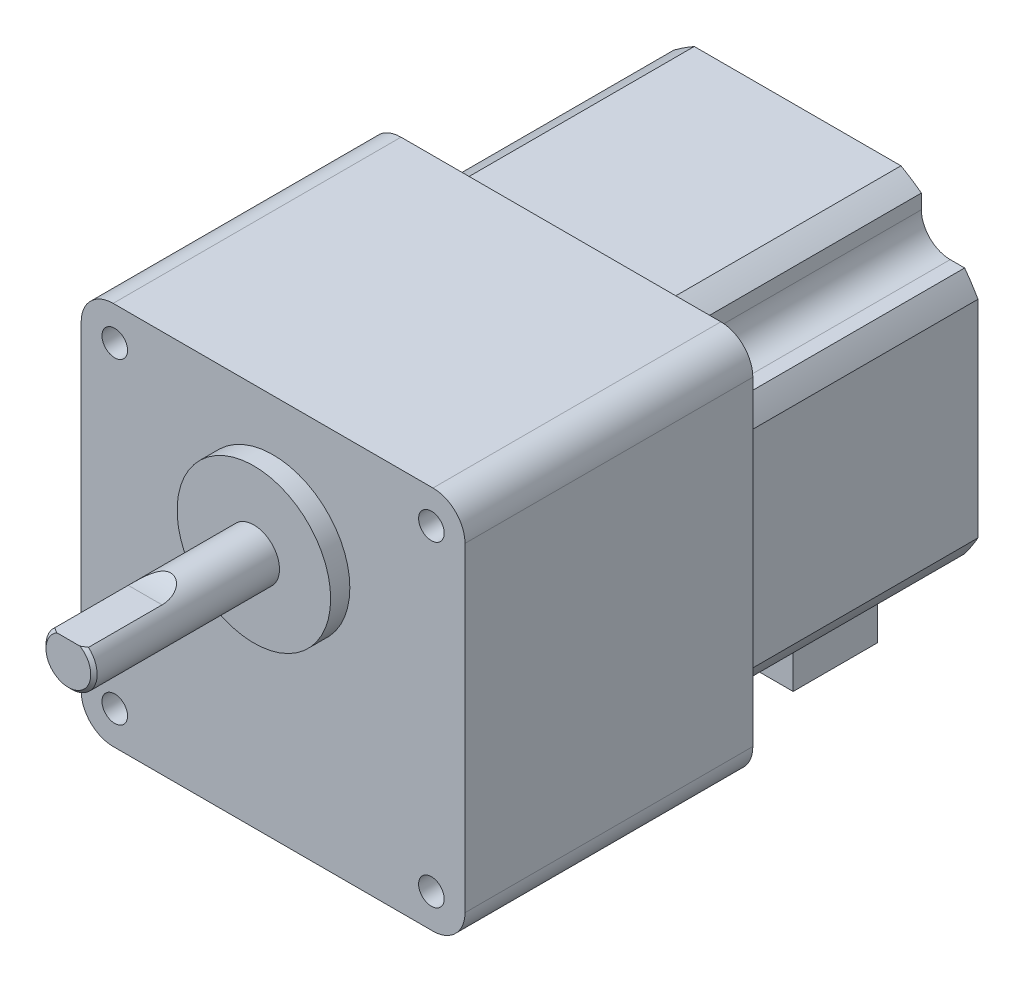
ISO-10303-21;
HEADER;
FILE_DESCRIPTION(('STEP AP214'),'2;1');
FILE_NAME('part.step','',(''),(''),'','','');
FILE_SCHEMA(('AUTOMOTIVE_DESIGN { 1 0 10303 214 1 1 1 1 }'));
ENDSEC;
DATA;
#1=APPLICATION_CONTEXT('core data for automotive mechanical design processes');
#2=APPLICATION_PROTOCOL_DEFINITION('international standard','automotive_design',2000,#1);
#3=PRODUCT_CONTEXT('',#1,'mechanical');
#4=PRODUCT('Part','Part','',(#3));
#5=PRODUCT_RELATED_PRODUCT_CATEGORY('part','',(#4));
#6=PRODUCT_DEFINITION_FORMATION('','',#4);
#7=PRODUCT_DEFINITION_CONTEXT('part definition',#1,'design');
#8=PRODUCT_DEFINITION('design','',#6,#7);
#9=PRODUCT_DEFINITION_SHAPE('','',#8);
#10=(LENGTH_UNIT() NAMED_UNIT(*) SI_UNIT(.MILLI.,.METRE.));
#11=(NAMED_UNIT(*) PLANE_ANGLE_UNIT() SI_UNIT($,.RADIAN.));
#12=(NAMED_UNIT(*) SI_UNIT($,.STERADIAN.) SOLID_ANGLE_UNIT());
#13=UNCERTAINTY_MEASURE_WITH_UNIT(LENGTH_MEASURE(1.E-05),#10,'distance_accuracy_value','');
#14=(GEOMETRIC_REPRESENTATION_CONTEXT(3) GLOBAL_UNCERTAINTY_ASSIGNED_CONTEXT((#13)) GLOBAL_UNIT_ASSIGNED_CONTEXT((#10,
#11,#12)) REPRESENTATION_CONTEXT('',''));
#15=CARTESIAN_POINT('',(0.,0.,0.));
#16=DIRECTION('',(0.,0.,1.));
#17=DIRECTION('',(1.,0.,0.));
#18=AXIS2_PLACEMENT_3D('',#15,#16,#17);
#19=CARTESIAN_POINT('',(0.,-10.,-98.));
#20=DIRECTION('',(0.,0.,1.));
#21=DIRECTION('',(1.,0.,0.));
#22=AXIS2_PLACEMENT_3D('',#19,#20,#21);
#23=CYLINDRICAL_SURFACE('',#22,3.175);
#24=CARTESIAN_POINT('',(0.,-10.,-96.5));
#25=DIRECTION('',(0.,0.,-1.));
#26=DIRECTION('',(-1.,0.,0.));
#27=AXIS2_PLACEMENT_3D('',#24,#25,#26);
#28=CIRCLE('',#27,3.175);
#29=CARTESIAN_POINT('',(-1.78605710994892,-7.375,-96.500000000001));
#30=VERTEX_POINT('',#29);
#31=CARTESIAN_POINT('',(1.78605710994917,-7.375,-96.5));
#32=VERTEX_POINT('',#31);
#33=EDGE_CURVE('E95',#30,#32,#28,.F.);
#34=ORIENTED_EDGE('',*,*,#33,.T.);
#35=DIRECTION('',(0.,0.,1.));
#36=VECTOR('',#35,1.);
#37=CARTESIAN_POINT('',(1.78605710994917,-7.375,-98.));
#38=LINE('',#37,#36);
#39=CARTESIAN_POINT('',(1.78605710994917,-7.375,-83.));
#40=VERTEX_POINT('',#39);
#41=EDGE_CURVE('E73',#32,#40,#38,.T.);
#42=ORIENTED_EDGE('',*,*,#41,.T.);
#43=CARTESIAN_POINT('',(0.,-10.,-83.));
#44=DIRECTION('',(0.,0.,-1.));
#45=DIRECTION('',(-1.,0.,0.));
#46=AXIS2_PLACEMENT_3D('',#43,#44,#45);
#47=CIRCLE('',#46,3.175);
#48=CARTESIAN_POINT('',(-1.78605710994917,-7.375,-83.));
#49=VERTEX_POINT('',#48);
#50=EDGE_CURVE('E13',#49,#40,#47,.T.);
#51=ORIENTED_EDGE('',*,*,#50,.F.);
#52=DIRECTION('',(0.,0.,1.));
#53=VECTOR('',#52,1.);
#54=CARTESIAN_POINT('',(-1.78605710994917,-7.375,-98.));
#55=LINE('',#54,#53);
#56=EDGE_CURVE('E125',#49,#30,#55,.F.);
#57=ORIENTED_EDGE('',*,*,#56,.T.);
#58=EDGE_LOOP('',(#34,#42,#51,#57));
#59=FACE_BOUND('',#58,.T.);
#60=CARTESIAN_POINT('',(0.,-10.,-82.));
#61=DIRECTION('',(0.,0.,-1.));
#62=DIRECTION('',(-1.,0.,0.));
#63=AXIS2_PLACEMENT_3D('',#60,#61,#62);
#64=CIRCLE('',#63,3.175);
#65=CARTESIAN_POINT('',(-3.175,-10.,-82.));
#66=VERTEX_POINT('',#65);
#67=EDGE_CURVE('E96',#66,#66,#64,.T.);
#68=ORIENTED_EDGE('',*,*,#67,.T.);
#69=EDGE_LOOP('',(#68));
#70=FACE_BOUND('',#69,.T.);
#71=ADVANCED_FACE('F51',(#59,#70),#23,.T.);
#72=CARTESIAN_POINT('',(0.,-10.,-98.));
#73=DIRECTION('',(0.,0.,-1.));
#74=DIRECTION('',(-1.,0.,0.));
#75=AXIS2_PLACEMENT_3D('',#72,#73,#74);
#76=PLANE('',#75);
#77=DIRECTION('',(-1.,0.,0.));
#78=VECTOR('',#77,1.);
#79=CARTESIAN_POINT('',(3.58623062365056,-7.375,-98.));
#80=LINE('',#79,#78);
#81=CARTESIAN_POINT('',(0.894050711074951,-7.375,-98.));
#82=VERTEX_POINT('',#81);
#83=CARTESIAN_POINT('',(-0.894050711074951,-7.375,-98.));
#84=VERTEX_POINT('',#83);
#85=EDGE_CURVE('E67',#82,#84,#80,.T.);
#86=ORIENTED_EDGE('',*,*,#85,.F.);
#87=CARTESIAN_POINT('',(0.,-10.,-98.));
#88=DIRECTION('',(0.,0.,-1.));
#89=DIRECTION('',(-1.,0.,0.));
#90=AXIS2_PLACEMENT_3D('',#87,#88,#89);
#91=CIRCLE('',#90,2.77307621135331);
#92=EDGE_CURVE('E92',#82,#84,#91,.T.);
#93=ORIENTED_EDGE('',*,*,#92,.T.);
#94=EDGE_LOOP('',(#86,#93));
#95=FACE_BOUND('',#94,.T.);
#96=ADVANCED_FACE('F91',(#95),#76,.T.);
#97=CARTESIAN_POINT('',(0.,-10.,-82.));
#98=DIRECTION('',(0.,0.,-1.));
#99=DIRECTION('',(-1.,0.,0.));
#100=AXIS2_PLACEMENT_3D('',#97,#98,#99);
#101=PLANE('',#100);
#102=ORIENTED_EDGE('',*,*,#67,.F.);
#103=EDGE_LOOP('',(#102));
#104=FACE_BOUND('',#103,.T.);
#105=ADVANCED_FACE('F114',(#104),#101,.F.);
#106=CARTESIAN_POINT('',(0.,-10.,-98.));
#107=DIRECTION('',(0.,0.,1.));
#108=DIRECTION('',(1.,0.,0.));
#109=AXIS2_PLACEMENT_3D('',#106,#107,#108);
#110=CONICAL_SURFACE('',#109,2.77307621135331,0.261799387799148);
#111=CARTESIAN_POINT('',(3.30935894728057,-7.375,-92.5849436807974));
#112=CARTESIAN_POINT('',(3.24542473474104,-7.375,-92.7718399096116));
#113=CARTESIAN_POINT('',(3.18087365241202,-7.375,-92.9585279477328));
#114=CARTESIAN_POINT('',(3.05023975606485,-7.375,-93.3313889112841));
#115=CARTESIAN_POINT('',(2.98415678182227,-7.375,-93.517561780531));
#116=CARTESIAN_POINT('',(2.85014549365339,-7.375,-93.8893346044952));
#117=CARTESIAN_POINT('',(2.78221639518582,-7.375,-94.0749342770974));
#118=CARTESIAN_POINT('',(2.64413585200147,-7.375,-94.445295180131));
#119=CARTESIAN_POINT('',(2.57398453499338,-7.375,-94.6300564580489));
#120=CARTESIAN_POINT('',(2.4308845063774,-7.375,-94.9985625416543));
#121=CARTESIAN_POINT('',(2.35793492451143,-7.375,-95.1823070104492));
#122=CARTESIAN_POINT('',(2.20847433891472,-7.375,-95.548383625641));
#123=CARTESIAN_POINT('',(2.13196278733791,-7.375,-95.7307155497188));
#124=CARTESIAN_POINT('',(1.97412292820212,-7.375,-96.0936282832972));
#125=CARTESIAN_POINT('',(1.89278731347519,-7.375,-96.2742059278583));
#126=CARTESIAN_POINT('',(1.72367545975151,-7.375,-96.6322943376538));
#127=CARTESIAN_POINT('',(1.63590163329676,-7.375,-96.8098062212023));
#128=CARTESIAN_POINT('',(1.49689402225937,-7.375,-97.0727010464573));
#129=CARTESIAN_POINT('',(1.44921905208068,-7.375,-97.1599613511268));
#130=CARTESIAN_POINT('',(1.35081442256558,-7.375,-97.3328001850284));
#131=CARTESIAN_POINT('',(1.30008362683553,-7.375,-97.4183780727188));
#132=CARTESIAN_POINT('',(1.19492866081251,-7.375,-97.5868191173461));
#133=CARTESIAN_POINT('',(1.14051856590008,-7.375,-97.669691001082));
#134=CARTESIAN_POINT('',(1.02665023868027,-7.375,-97.8318604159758));
#135=CARTESIAN_POINT('',(0.967196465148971,-7.375,-97.9111610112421));
#136=CARTESIAN_POINT('',(0.862242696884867,-7.375,-98.0387203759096));
#137=CARTESIAN_POINT('',(0.818661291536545,-7.375,-98.0885458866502));
#138=CARTESIAN_POINT('',(0.727513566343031,-7.375,-98.1846578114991));
#139=CARTESIAN_POINT('',(0.679939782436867,-7.375,-98.2309372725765));
#140=CARTESIAN_POINT('',(0.579402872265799,-7.375,-98.3185048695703));
#141=CARTESIAN_POINT('',(0.526387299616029,-7.375,-98.3597339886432));
#142=CARTESIAN_POINT('',(0.414507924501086,-7.375,-98.4333493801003));
#143=CARTESIAN_POINT('',(0.355665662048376,-7.375,-98.4657666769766));
#144=CARTESIAN_POINT('',(0.254920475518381,-7.375,-98.5076037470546));
#145=CARTESIAN_POINT('',(0.214733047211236,-7.375,-98.5210971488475));
#146=CARTESIAN_POINT('',(0.132696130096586,-7.375,-98.5413023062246));
#147=CARTESIAN_POINT('',(0.0908493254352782,-7.375,-98.5480245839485));
#148=CARTESIAN_POINT('',(0.00641419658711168,-7.375,-98.5538691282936));
#149=CARTESIAN_POINT('',(-0.0361766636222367,-7.375,-98.5529560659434));
#150=CARTESIAN_POINT('',(-0.120530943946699,-7.375,-98.5435732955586));
#151=CARTESIAN_POINT('',(-0.162293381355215,-7.375,-98.5350951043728));
#152=CARTESIAN_POINT('',(-0.254092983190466,-7.375,-98.5086701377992));
#153=CARTESIAN_POINT('',(-0.303590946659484,-7.375,-98.488887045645));
#154=CARTESIAN_POINT('',(-0.398827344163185,-7.375,-98.4417789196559));
#155=CARTESIAN_POINT('',(-0.444557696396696,-7.375,-98.4144381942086));
#156=CARTESIAN_POINT('',(-0.52815292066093,-7.375,-98.3573624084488));
#157=CARTESIAN_POINT('',(-0.566351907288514,-7.375,-98.3281050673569));
#158=CARTESIAN_POINT('',(-0.640136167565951,-7.375,-98.266433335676));
#159=CARTESIAN_POINT('',(-0.675718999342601,-7.375,-98.2340160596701));
#160=CARTESIAN_POINT('',(-0.744720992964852,-7.375,-98.1667643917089));
#161=CARTESIAN_POINT('',(-0.778132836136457,-7.375,-98.131922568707));
#162=CARTESIAN_POINT('',(-0.842993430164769,-7.375,-98.0605004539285));
#163=CARTESIAN_POINT('',(-0.874443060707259,-7.375,-98.0239209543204));
#164=CARTESIAN_POINT('',(-0.960526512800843,-7.375,-97.9192141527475));
#165=CARTESIAN_POINT('',(-1.01328788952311,-7.375,-97.8495504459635));
#166=CARTESIAN_POINT('',(-1.11474355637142,-7.375,-97.7073019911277));
#167=CARTESIAN_POINT('',(-1.1634349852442,-7.375,-97.6347152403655));
#168=CARTESIAN_POINT('',(-1.25772470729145,-7.375,-97.4873519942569));
#169=CARTESIAN_POINT('',(-1.30331615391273,-7.375,-97.4125711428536));
#170=CARTESIAN_POINT('',(-1.39194135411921,-7.375,-97.2615031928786));
#171=CARTESIAN_POINT('',(-1.43497467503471,-7.375,-97.185215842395));
#172=CARTESIAN_POINT('',(-1.56162993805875,-7.375,-96.9534626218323));
#173=CARTESIAN_POINT('',(-1.64208680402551,-7.375,-96.7962698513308));
#174=CARTESIAN_POINT('',(-1.79705705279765,-7.375,-96.4792970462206));
#175=CARTESIAN_POINT('',(-1.87157841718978,-7.375,-96.3195208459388));
#176=CARTESIAN_POINT('',(-2.01054641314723,-7.375,-96.0108615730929));
#177=CARTESIAN_POINT('',(-2.075322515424,-7.375,-95.8621261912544));
#178=CARTESIAN_POINT('',(-2.20202359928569,-7.375,-95.56344277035));
#179=CARTESIAN_POINT('',(-2.26394842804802,-7.375,-95.4134946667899));
#180=CARTESIAN_POINT('',(-2.44641955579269,-7.375,-94.9620477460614));
#181=CARTESIAN_POINT('',(-2.5635619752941,-7.375,-94.6591749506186));
#182=CARTESIAN_POINT('',(-2.78774888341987,-7.375,-94.0616544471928));
#183=CARTESIAN_POINT('',(-2.89500244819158,-7.375,-93.7670842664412));
#184=CARTESIAN_POINT('',(-3.05264619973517,-7.375,-93.3242983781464));
#185=CARTESIAN_POINT('',(-3.10462177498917,-7.375,-93.1766447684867));
#186=CARTESIAN_POINT('',(-3.20764960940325,-7.375,-92.881020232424));
#187=CARTESIAN_POINT('',(-3.25870189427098,-7.375,-92.7330493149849));
#188=CARTESIAN_POINT('',(-3.30935894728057,-7.375,-92.5849436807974));
#189=B_SPLINE_CURVE_WITH_KNOTS('',3,(#111,#112,#113,#114,#115,#116,#117,#118,#119,#120,#121,
#122,#123,#124,#125,#126,#127,#128,#129,#130,#131,#132,#133,#134,#135,#136,#137,#138,#139,#140,
#141,#142,#143,#144,#145,#146,#147,#148,#149,#150,#151,#152,#153,#154,#155,#156,#157,#158,#159,
#160,#161,#162,#163,#164,#165,#166,#167,#168,#169,#170,#171,#172,#173,#174,#175,#176,#177,#178,
#179,#180,#181,#182,#183,#184,#185,#186,#187,#188),.UNSPECIFIED.,.F.,.F.,(4,2,2,2,2,2,2,2,2,2,2,
2,2,2,2,2,2,2,2,2,2,2,2,2,2,2,2,2,2,2,2,2,2,2,2,2,2,2,4),(0.,0.592590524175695,1.18524331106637,
1.77815202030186,2.37102671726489,2.96408731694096,3.55723943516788,4.15131417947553,
4.74516743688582,5.04342777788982,5.3417997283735,5.63908859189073,5.93611732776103,
6.13455567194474,6.33337364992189,6.53432931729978,6.73456801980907,6.86126706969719,
6.98776892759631,7.11485643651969,7.24208663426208,7.40110146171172,7.56044895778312,
7.70458491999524,7.84885375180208,7.99358608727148,8.13825306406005,8.40019160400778,
8.6623127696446,8.92499521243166,9.1877219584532,9.71727649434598,10.2461064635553,
10.7327538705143,11.2194273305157,12.1935231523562,13.133951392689,13.6035521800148,
14.0731398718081),.UNSPECIFIED.);
#190=EDGE_CURVE('E60',#32,#82,#189,.T.);
#191=ORIENTED_EDGE('',*,*,#190,.F.);
#192=ORIENTED_EDGE('',*,*,#33,.F.);
#193=EDGE_CURVE('E88',#84,#30,#189,.T.);
#194=ORIENTED_EDGE('',*,*,#193,.F.);
#195=ORIENTED_EDGE('',*,*,#92,.F.);
#196=EDGE_LOOP('',(#191,#192,#194,#195));
#197=FACE_BOUND('',#196,.T.);
#198=ADVANCED_FACE('F53',(#197),#110,.T.);
#199=CARTESIAN_POINT('',(0.,0.,-83.));
#200=DIRECTION('',(0.,0.,-1.));
#201=DIRECTION('',(-1.,0.,0.));
#202=AXIS2_PLACEMENT_3D('',#199,#200,#201);
#203=PLANE('',#202);
#204=ORIENTED_EDGE('',*,*,#50,.T.);
#205=DIRECTION('',(-1.,0.,0.));
#206=VECTOR('',#205,1.);
#207=CARTESIAN_POINT('',(3.58623062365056,-7.375,-83.));
#208=LINE('',#207,#206);
#209=EDGE_CURVE('E93',#40,#49,#208,.T.);
#210=ORIENTED_EDGE('',*,*,#209,.T.);
#211=EDGE_LOOP('',(#204,#210));
#212=FACE_BOUND('',#211,.T.);
#213=ADVANCED_FACE('F111',(#212),#203,.T.);
#214=CARTESIAN_POINT('',(3.58623062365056,-7.375,-83.));
#215=DIRECTION('',(0.,-1.,0.));
#216=DIRECTION('',(0.,0.,-1.));
#217=AXIS2_PLACEMENT_3D('',#214,#215,#216);
#218=PLANE('',#217);
#219=ORIENTED_EDGE('',*,*,#190,.T.);
#220=ORIENTED_EDGE('',*,*,#85,.T.);
#221=ORIENTED_EDGE('',*,*,#193,.T.);
#222=ORIENTED_EDGE('',*,*,#56,.F.);
#223=ORIENTED_EDGE('',*,*,#209,.F.);
#224=ORIENTED_EDGE('',*,*,#41,.F.);
#225=EDGE_LOOP('',(#219,#220,#221,#222,#223,#224));
#226=FACE_BOUND('',#225,.T.);
#227=ADVANCED_FACE('F83',(#226),#218,.F.);
#228=CLOSED_SHELL('',(#71,#96,#105,#198,#213,#227));
#229=MANIFOLD_SOLID_BREP('B2',#228);
#230=CARTESIAN_POINT('',(-12.5,-48.2,-82.));
#231=DIRECTION('',(1.,0.,0.));
#232=DIRECTION('',(0.,0.,-1.));
#233=AXIS2_PLACEMENT_3D('',#230,#231,#232);
#234=PLANE('',#233);
#235=DIRECTION('',(0.,0.,-1.));
#236=VECTOR('',#235,1.);
#237=CARTESIAN_POINT('',(-12.5,-38.2,-82.));
#238=LINE('',#237,#236);
#239=CARTESIAN_POINT('',(-12.5,-38.2,-68.8));
#240=VERTEX_POINT('',#239);
#241=CARTESIAN_POINT('',(-12.5,-38.2,-82.));
#242=VERTEX_POINT('',#241);
#243=EDGE_CURVE('E241',#240,#242,#238,.T.);
#244=ORIENTED_EDGE('',*,*,#243,.T.);
#245=DIRECTION('',(0.,1.,0.));
#246=VECTOR('',#245,1.);
#247=CARTESIAN_POINT('',(-12.5,-48.2,-82.));
#248=LINE('',#247,#246);
#249=CARTESIAN_POINT('',(-12.5,-48.2,-82.));
#250=VERTEX_POINT('',#249);
#251=EDGE_CURVE('E49',#250,#242,#248,.T.);
#252=ORIENTED_EDGE('',*,*,#251,.F.);
#253=DIRECTION('',(0.,0.,-1.));
#254=VECTOR('',#253,1.);
#255=CARTESIAN_POINT('',(-12.5,-48.2,-82.));
#256=LINE('',#255,#254);
#257=CARTESIAN_POINT('',(-12.5,-48.2,-68.8));
#258=VERTEX_POINT('',#257);
#259=EDGE_CURVE('E229',#258,#250,#256,.T.);
#260=ORIENTED_EDGE('',*,*,#259,.F.);
#261=DIRECTION('',(0.,1.,0.));
#262=VECTOR('',#261,1.);
#263=CARTESIAN_POINT('',(-12.5,-48.2,-68.8));
#264=LINE('',#263,#262);
#265=EDGE_CURVE('E237',#258,#240,#264,.T.);
#266=ORIENTED_EDGE('',*,*,#265,.T.);
#267=EDGE_LOOP('',(#244,#252,#260,#266));
#268=FACE_BOUND('',#267,.T.);
#269=ADVANCED_FACE('F178',(#268),#234,.F.);
#270=CARTESIAN_POINT('',(-12.5,-48.2,-82.));
#271=DIRECTION('',(0.,0.,1.));
#272=DIRECTION('',(1.,0.,0.));
#273=AXIS2_PLACEMENT_3D('',#270,#271,#272);
#274=PLANE('',#273);
#275=DIRECTION('',(1.,0.,0.));
#276=VECTOR('',#275,1.);
#277=CARTESIAN_POINT('',(-12.5,-38.2,-82.));
#278=LINE('',#277,#276);
#279=CARTESIAN_POINT('',(12.5,-38.2,-82.));
#280=VERTEX_POINT('',#279);
#281=EDGE_CURVE('E233',#242,#280,#278,.T.);
#282=ORIENTED_EDGE('',*,*,#281,.T.);
#283=DIRECTION('',(0.,1.,0.));
#284=VECTOR('',#283,1.);
#285=CARTESIAN_POINT('',(12.5,-48.2,-82.));
#286=LINE('',#285,#284);
#287=CARTESIAN_POINT('',(12.5,-48.2,-82.));
#288=VERTEX_POINT('',#287);
#289=EDGE_CURVE('E186',#288,#280,#286,.T.);
#290=ORIENTED_EDGE('',*,*,#289,.F.);
#291=DIRECTION('',(1.,0.,0.));
#292=VECTOR('',#291,1.);
#293=CARTESIAN_POINT('',(-12.5,-48.2,-82.));
#294=LINE('',#293,#292);
#295=EDGE_CURVE('E224',#250,#288,#294,.T.);
#296=ORIENTED_EDGE('',*,*,#295,.F.);
#297=ORIENTED_EDGE('',*,*,#251,.T.);
#298=EDGE_LOOP('',(#282,#290,#296,#297));
#299=FACE_BOUND('',#298,.T.);
#300=ADVANCED_FACE('F232',(#299),#274,.F.);
#301=CARTESIAN_POINT('',(12.5,-48.2,-82.));
#302=DIRECTION('',(-1.,0.,0.));
#303=DIRECTION('',(0.,0.,1.));
#304=AXIS2_PLACEMENT_3D('',#301,#302,#303);
#305=PLANE('',#304);
#306=DIRECTION('',(0.,0.,1.));
#307=VECTOR('',#306,1.);
#308=CARTESIAN_POINT('',(12.5,-38.2,-82.));
#309=LINE('',#308,#307);
#310=CARTESIAN_POINT('',(12.5,-38.2,-68.8));
#311=VERTEX_POINT('',#310);
#312=EDGE_CURVE('E211',#280,#311,#309,.T.);
#313=ORIENTED_EDGE('',*,*,#312,.T.);
#314=DIRECTION('',(0.,1.,0.));
#315=VECTOR('',#314,1.);
#316=CARTESIAN_POINT('',(12.5,-48.2,-68.8));
#317=LINE('',#316,#315);
#318=CARTESIAN_POINT('',(12.5,-48.2,-68.8));
#319=VERTEX_POINT('',#318);
#320=EDGE_CURVE('E234',#319,#311,#317,.T.);
#321=ORIENTED_EDGE('',*,*,#320,.F.);
#322=DIRECTION('',(0.,0.,1.));
#323=VECTOR('',#322,1.);
#324=CARTESIAN_POINT('',(12.5,-48.2,-82.));
#325=LINE('',#324,#323);
#326=EDGE_CURVE('E227',#288,#319,#325,.T.);
#327=ORIENTED_EDGE('',*,*,#326,.F.);
#328=ORIENTED_EDGE('',*,*,#289,.T.);
#329=EDGE_LOOP('',(#313,#321,#327,#328));
#330=FACE_BOUND('',#329,.T.);
#331=ADVANCED_FACE('F235',(#330),#305,.F.);
#332=CARTESIAN_POINT('',(-12.5,-48.2,-68.8));
#333=DIRECTION('',(0.,0.,-1.));
#334=DIRECTION('',(-1.,0.,0.));
#335=AXIS2_PLACEMENT_3D('',#332,#333,#334);
#336=PLANE('',#335);
#337=DIRECTION('',(-1.,0.,0.));
#338=VECTOR('',#337,1.);
#339=CARTESIAN_POINT('',(-12.5,-38.2,-68.8));
#340=LINE('',#339,#338);
#341=EDGE_CURVE('E217',#311,#240,#340,.T.);
#342=ORIENTED_EDGE('',*,*,#341,.T.);
#343=ORIENTED_EDGE('',*,*,#265,.F.);
#344=DIRECTION('',(-1.,0.,0.));
#345=VECTOR('',#344,1.);
#346=CARTESIAN_POINT('',(-12.5,-48.2,-68.8));
#347=LINE('',#346,#345);
#348=EDGE_CURVE('E194',#319,#258,#347,.T.);
#349=ORIENTED_EDGE('',*,*,#348,.F.);
#350=ORIENTED_EDGE('',*,*,#320,.T.);
#351=EDGE_LOOP('',(#342,#343,#349,#350));
#352=FACE_BOUND('',#351,.T.);
#353=ADVANCED_FACE('F248',(#352),#336,.F.);
#354=CARTESIAN_POINT('',(0.,-48.2,0.));
#355=DIRECTION('',(0.,1.,0.));
#356=DIRECTION('',(0.,0.,1.));
#357=AXIS2_PLACEMENT_3D('',#354,#355,#356);
#358=PLANE('',#357);
#359=ORIENTED_EDGE('',*,*,#259,.T.);
#360=ORIENTED_EDGE('',*,*,#295,.T.);
#361=ORIENTED_EDGE('',*,*,#326,.T.);
#362=ORIENTED_EDGE('',*,*,#348,.T.);
#363=EDGE_LOOP('',(#359,#360,#361,#362));
#364=FACE_BOUND('',#363,.T.);
#365=ADVANCED_FACE('F225',(#364),#358,.F.);
#366=CARTESIAN_POINT('',(0.,-38.2,0.));
#367=DIRECTION('',(0.,1.,0.));
#368=DIRECTION('',(0.,0.,1.));
#369=AXIS2_PLACEMENT_3D('',#366,#367,#368);
#370=PLANE('',#369);
#371=ORIENTED_EDGE('',*,*,#243,.F.);
#372=ORIENTED_EDGE('',*,*,#341,.F.);
#373=ORIENTED_EDGE('',*,*,#312,.F.);
#374=ORIENTED_EDGE('',*,*,#281,.F.);
#375=EDGE_LOOP('',(#371,#372,#373,#374));
#376=FACE_BOUND('',#375,.T.);
#377=ADVANCED_FACE('F251',(#376),#370,.T.);
#378=CLOSED_SHELL('',(#269,#300,#331,#353,#365,#377));
#379=MANIFOLD_SOLID_BREP('B7',#378);
#380=CARTESIAN_POINT('',(0.,0.,3.));
#381=DIRECTION('',(0.,0.,-1.));
#382=DIRECTION('',(-1.,0.,0.));
#383=AXIS2_PLACEMENT_3D('',#380,#381,#382);
#384=CYLINDRICAL_SURFACE('',#383,12.);
#385=CARTESIAN_POINT('',(0.,0.,3.));
#386=DIRECTION('',(0.,0.,1.));
#387=DIRECTION('',(1.,0.,0.));
#388=AXIS2_PLACEMENT_3D('',#385,#386,#387);
#389=CIRCLE('',#388,12.);
#390=CARTESIAN_POINT('',(12.,0.,3.));
#391=VERTEX_POINT('',#390);
#392=EDGE_CURVE('E628',#391,#391,#389,.T.);
#393=ORIENTED_EDGE('',*,*,#392,.F.);
#394=EDGE_LOOP('',(#393));
#395=FACE_BOUND('',#394,.T.);
#396=CARTESIAN_POINT('',(0.,0.,0.));
#397=DIRECTION('',(0.,0.,1.));
#398=DIRECTION('',(1.,0.,0.));
#399=AXIS2_PLACEMENT_3D('',#396,#397,#398);
#400=CIRCLE('',#399,12.);
#401=CARTESIAN_POINT('',(12.,0.,0.));
#402=VERTEX_POINT('',#401);
#403=EDGE_CURVE('E616',#402,#402,#400,.T.);
#404=ORIENTED_EDGE('',*,*,#403,.T.);
#405=EDGE_LOOP('',(#404));
#406=FACE_BOUND('',#405,.T.);
#407=ADVANCED_FACE('F302',(#395,#406),#384,.T.);
#408=CARTESIAN_POINT('',(0.,0.,3.));
#409=DIRECTION('',(0.,0.,1.));
#410=DIRECTION('',(1.,0.,0.));
#411=AXIS2_PLACEMENT_3D('',#408,#409,#410);
#412=PLANE('',#411);
#413=CARTESIAN_POINT('',(0.,0.,3.));
#414=DIRECTION('',(0.,0.,1.));
#415=DIRECTION('',(1.,0.,0.));
#416=AXIS2_PLACEMENT_3D('',#413,#414,#415);
#417=CIRCLE('',#416,4.);
#418=CARTESIAN_POINT('',(4.,0.,3.));
#419=VERTEX_POINT('',#418);
#420=EDGE_CURVE('E629',#419,#419,#417,.T.);
#421=ORIENTED_EDGE('',*,*,#420,.F.);
#422=EDGE_LOOP('',(#421));
#423=FACE_BOUND('',#422,.T.);
#424=ORIENTED_EDGE('',*,*,#392,.T.);
#425=EDGE_LOOP('',(#424));
#426=FACE_BOUND('',#425,.T.);
#427=ADVANCED_FACE('F682',(#423,#426),#412,.T.);
#428=CARTESIAN_POINT('',(0.,0.,32.));
#429=DIRECTION('',(0.,0.,-1.));
#430=DIRECTION('',(-1.,0.,0.));
#431=AXIS2_PLACEMENT_3D('',#428,#429,#430);
#432=CYLINDRICAL_SURFACE('',#431,4.);
#433=CARTESIAN_POINT('',(0.,0.,31.5));
#434=DIRECTION('',(0.,0.,1.));
#435=DIRECTION('',(1.,0.,0.));
#436=AXIS2_PLACEMENT_3D('',#433,#434,#435);
#437=CIRCLE('',#436,4.);
#438=CARTESIAN_POINT('',(2.64575131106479,3.,31.5));
#439=VERTEX_POINT('',#438);
#440=CARTESIAN_POINT('',(-2.6457513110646,3.,31.5));
#441=VERTEX_POINT('',#440);
#442=EDGE_CURVE('E639',#439,#441,#437,.F.);
#443=ORIENTED_EDGE('',*,*,#442,.T.);
#444=DIRECTION('',(0.,0.,-1.));
#445=VECTOR('',#444,1.);
#446=CARTESIAN_POINT('',(-2.64575131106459,3.,32.));
#447=LINE('',#446,#445);
#448=CARTESIAN_POINT('',(-2.64575131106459,3.,20.));
#449=VERTEX_POINT('',#448);
#450=EDGE_CURVE('E625',#441,#449,#447,.T.);
#451=ORIENTED_EDGE('',*,*,#450,.T.);
#452=CARTESIAN_POINT('',(-2.64575131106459,3.,20.));
#453=CARTESIAN_POINT('',(-2.64574586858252,2.99999908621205,19.915243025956));
#454=CARTESIAN_POINT('',(-2.64431426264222,3.00126819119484,19.8304982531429));
#455=CARTESIAN_POINT('',(-2.63855647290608,3.00633339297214,19.6611750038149));
#456=CARTESIAN_POINT('',(-2.63423001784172,3.01012972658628,19.5765965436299));
#457=CARTESIAN_POINT('',(-2.61682033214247,3.02531148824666,19.3229823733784));
#458=CARTESIAN_POINT('',(-2.59930641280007,3.04048959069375,19.1544356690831));
#459=CARTESIAN_POINT('',(-2.55139380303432,3.08080825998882,18.8183944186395));
#460=CARTESIAN_POINT('',(-2.52084927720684,3.1060613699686,18.6509342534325));
#461=CARTESIAN_POINT('',(-2.4454378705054,3.16577982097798,18.3210791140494));
#462=CARTESIAN_POINT('',(-2.40058932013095,3.20023336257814,18.1586779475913));
#463=CARTESIAN_POINT('',(-2.31746041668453,3.26048157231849,17.9097880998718));
#464=CARTESIAN_POINT('',(-2.28469563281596,3.28359802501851,17.8207796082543));
#465=CARTESIAN_POINT('',(-2.2134415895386,3.33204718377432,17.6456877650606));
#466=CARTESIAN_POINT('',(-2.17495257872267,3.35737979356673,17.5596042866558));
#467=CARTESIAN_POINT('',(-2.09194107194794,3.40971844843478,17.391346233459));
#468=CARTESIAN_POINT('',(-2.04744226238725,3.43671770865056,17.3091579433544));
#469=CARTESIAN_POINT('',(-1.95185752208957,3.49188974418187,17.1491508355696));
#470=CARTESIAN_POINT('',(-1.90077328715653,3.52006221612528,17.07133090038));
#471=CARTESIAN_POINT('',(-1.76292503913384,3.59178487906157,16.8814941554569));
#472=CARTESIAN_POINT('',(-1.67148504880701,3.63566248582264,16.7729090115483));
#473=CARTESIAN_POINT('',(-1.47129303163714,3.72116740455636,16.5719254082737));
#474=CARTESIAN_POINT('',(-1.36255778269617,3.7627968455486,16.4795114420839));
#475=CARTESIAN_POINT('',(-1.15089494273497,3.832143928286,16.3312996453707));
#476=CARTESIAN_POINT('',(-1.05089172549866,3.86099619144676,16.2718773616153));
#477=CARTESIAN_POINT('',(-0.841299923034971,3.91200906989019,16.1691127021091));
#478=CARTESIAN_POINT('',(-0.731715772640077,3.93417276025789,16.1257629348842));
#479=CARTESIAN_POINT('',(-0.504833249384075,3.96968368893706,16.0571755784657));
#480=CARTESIAN_POINT('',(-0.387491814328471,3.98297620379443,16.0320503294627));
#481=CARTESIAN_POINT('',(-0.149548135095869,3.99897769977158,16.0018784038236));
#482=CARTESIAN_POINT('',(-0.0289474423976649,4.00169163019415,15.9968223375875));
#483=CARTESIAN_POINT('',(0.198670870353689,3.99651694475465,16.0065371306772));
#484=CARTESIAN_POINT('',(0.305805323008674,3.98969406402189,16.0193148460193));
#485=CARTESIAN_POINT('',(0.516124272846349,3.9679709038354,16.0605742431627));
#486=CARTESIAN_POINT('',(0.619308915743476,3.95307092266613,16.0890553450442));
#487=CARTESIAN_POINT('',(0.820147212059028,3.91636153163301,16.1607236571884));
#488=CARTESIAN_POINT('',(0.917742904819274,3.89449130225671,16.20404057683));
#489=CARTESIAN_POINT('',(1.10470962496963,3.84564343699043,16.3035290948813));
#490=CARTESIAN_POINT('',(1.19407701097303,3.81866355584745,16.3597063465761));
#491=CARTESIAN_POINT('',(1.39900220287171,3.74951515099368,16.5086981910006));
#492=CARTESIAN_POINT('',(1.5099939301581,3.70569653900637,16.6070330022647));
#493=CARTESIAN_POINT('',(1.71340644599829,3.61616731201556,16.8205970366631));
#494=CARTESIAN_POINT('',(1.80579482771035,3.57045355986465,16.9358551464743));
#495=CARTESIAN_POINT('',(1.94750864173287,3.49450021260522,17.1416603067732));
#496=CARTESIAN_POINT('',(2.00136578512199,3.46380103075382,17.2289947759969));
#497=CARTESIAN_POINT('',(2.10130529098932,3.40410185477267,17.4085950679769));
#498=CARTESIAN_POINT('',(2.14738471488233,3.37510250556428,17.5008627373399));
#499=CARTESIAN_POINT('',(2.2325150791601,3.31940851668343,17.6896643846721));
#500=CARTESIAN_POINT('',(2.2715397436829,3.29272267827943,17.7862127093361));
#501=CARTESIAN_POINT('',(2.34297066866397,3.24228257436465,17.98248158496));
#502=CARTESIAN_POINT('',(2.37537507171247,3.21852913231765,18.082203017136));
#503=CARTESIAN_POINT('',(2.44716630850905,3.16452452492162,18.3290385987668));
#504=CARTESIAN_POINT('',(2.48325452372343,3.13607822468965,18.4775161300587));
#505=CARTESIAN_POINT('',(2.54411835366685,3.08690514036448,18.7780872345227));
#506=CARTESIAN_POINT('',(2.5688855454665,3.06618410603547,18.9301834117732));
#507=CARTESIAN_POINT('',(2.60782082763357,3.03313644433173,19.2348677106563));
#508=CARTESIAN_POINT('',(2.62210551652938,3.02071761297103,19.3874308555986));
#509=CARTESIAN_POINT('',(2.63632519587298,3.00829224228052,19.6168979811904));
#510=CARTESIAN_POINT('',(2.63986389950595,3.00518427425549,19.6934407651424));
#511=CARTESIAN_POINT('',(2.64457510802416,3.00103786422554,19.8466527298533));
#512=CARTESIAN_POINT('',(2.64574769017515,2.99999935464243,19.9233219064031));
#513=CARTESIAN_POINT('',(2.6457513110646,3.,20.));
#514=B_SPLINE_CURVE_WITH_KNOTS('',3,(#452,#453,#454,#455,#456,#457,#458,#459,#460,#461,#462,
#463,#464,#465,#466,#467,#468,#469,#470,#471,#472,#473,#474,#475,#476,#477,#478,#479,#480,#481,
#482,#483,#484,#485,#486,#487,#488,#489,#490,#491,#492,#493,#494,#495,#496,#497,#498,#499,#500,
#501,#502,#503,#504,#505,#506,#507,#508,#509,#510,#511,#512,#513),.UNSPECIFIED.,.F.,.F.,(4,2,2,
2,2,2,2,2,2,2,2,2,2,2,2,2,2,2,2,2,2,2,2,2,2,2,2,2,2,2,4),(0.,0.25422445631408,0.508472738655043,
1.01806859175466,1.53352384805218,2.04832118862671,2.34099478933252,2.63365568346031,
2.92519505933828,3.21665951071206,3.66074875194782,4.10440978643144,4.46250594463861,
4.82043721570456,5.18055653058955,5.54050733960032,5.86329486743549,6.18607047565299,
6.51174336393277,6.83755969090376,7.2988867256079,7.76101056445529,8.08190764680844,
8.40292570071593,8.72511581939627,9.04739620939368,9.51292785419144,9.97880529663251,
10.4394187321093,10.6694264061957,10.899426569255),.UNSPECIFIED.);
#515=CARTESIAN_POINT('',(2.6457513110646,3.,20.));
#516=VERTEX_POINT('',#515);
#517=EDGE_CURVE('E651',#449,#516,#514,.T.);
#518=ORIENTED_EDGE('',*,*,#517,.T.);
#519=DIRECTION('',(0.,0.,-1.));
#520=VECTOR('',#519,1.);
#521=CARTESIAN_POINT('',(2.64575131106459,3.,32.));
#522=LINE('',#521,#520);
#523=EDGE_CURVE('E620',#516,#439,#522,.F.);
#524=ORIENTED_EDGE('',*,*,#523,.T.);
#525=EDGE_LOOP('',(#443,#451,#518,#524));
#526=FACE_BOUND('',#525,.T.);
#527=ORIENTED_EDGE('',*,*,#420,.T.);
#528=EDGE_LOOP('',(#527));
#529=FACE_BOUND('',#528,.T.);
#530=ADVANCED_FACE('F677',(#526,#529),#432,.T.);
#531=CARTESIAN_POINT('',(0.,0.,32.));
#532=DIRECTION('',(0.,0.,1.));
#533=DIRECTION('',(1.,0.,0.));
#534=AXIS2_PLACEMENT_3D('',#531,#532,#533);
#535=PLANE('',#534);
#536=DIRECTION('',(1.,0.,0.));
#537=VECTOR('',#536,1.);
#538=CARTESIAN_POINT('',(-5.,3.,32.));
#539=LINE('',#538,#537);
#540=CARTESIAN_POINT('',(-1.80277563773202,3.,32.));
#541=VERTEX_POINT('',#540);
#542=CARTESIAN_POINT('',(1.80277563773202,3.,32.));
#543=VERTEX_POINT('',#542);
#544=EDGE_CURVE('E621',#541,#543,#539,.T.);
#545=ORIENTED_EDGE('',*,*,#544,.F.);
#546=CARTESIAN_POINT('',(0.,0.,32.));
#547=DIRECTION('',(0.,0.,1.));
#548=DIRECTION('',(1.,0.,0.));
#549=AXIS2_PLACEMENT_3D('',#546,#547,#548);
#550=CIRCLE('',#549,3.50000000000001);
#551=EDGE_CURVE('E632',#541,#543,#550,.T.);
#552=ORIENTED_EDGE('',*,*,#551,.T.);
#553=EDGE_LOOP('',(#545,#552));
#554=FACE_BOUND('',#553,.T.);
#555=ADVANCED_FACE('F675',(#554),#535,.T.);
#556=CARTESIAN_POINT('',(0.,0.,32.));
#557=DIRECTION('',(0.,0.,-1.));
#558=DIRECTION('',(-1.,0.,0.));
#559=AXIS2_PLACEMENT_3D('',#556,#557,#558);
#560=CONICAL_SURFACE('',#559,3.50000000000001,0.785398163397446);
#561=CARTESIAN_POINT('',(-8.28302183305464,3.,26.6904341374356));
#562=CARTESIAN_POINT('',(-8.15263782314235,3.,26.8130230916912));
#563=CARTESIAN_POINT('',(-8.02208863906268,3.,26.9354362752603));
#564=CARTESIAN_POINT('',(-7.76060607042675,3.,27.1798531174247));
#565=CARTESIAN_POINT('',(-7.62967268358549,3.,27.3018567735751));
#566=CARTESIAN_POINT('',(-7.23603089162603,3.,27.6673377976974));
#567=CARTESIAN_POINT('',(-6.97266649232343,3.,27.9101103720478));
#568=CARTESIAN_POINT('',(-6.43676879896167,3.,28.3993162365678));
#569=CARTESIAN_POINT('',(-6.1641742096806,3.,28.6456824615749));
#570=CARTESIAN_POINT('',(-5.61571358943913,3.,29.1344175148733));
#571=CARTESIAN_POINT('',(-5.3398497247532,3.,29.3767887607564));
#572=CARTESIAN_POINT('',(-4.92236718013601,3.,29.7359102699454));
#573=CARTESIAN_POINT('',(-4.78263021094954,3.,29.8548466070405));
#574=CARTESIAN_POINT('',(-4.50160854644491,3.,30.0908741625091));
#575=CARTESIAN_POINT('',(-4.36032388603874,3.,30.2079654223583));
#576=CARTESIAN_POINT('',(-4.07554252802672,3.,30.4400375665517));
#577=CARTESIAN_POINT('',(-3.93204187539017,3.,30.5550136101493));
#578=CARTESIAN_POINT('',(-3.64263049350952,3.,30.7818781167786));
#579=CARTESIAN_POINT('',(-3.49671997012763,3.,30.8937668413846));
#580=CARTESIAN_POINT('',(-3.20338019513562,3.,31.1122717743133));
#581=CARTESIAN_POINT('',(-3.05598330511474,3.,31.2189312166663));
#582=CARTESIAN_POINT('',(-2.75726797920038,3.,31.4267949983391));
#583=CARTESIAN_POINT('',(-2.60594795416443,3.,31.527997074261));
#584=CARTESIAN_POINT('',(-2.29890420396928,3.,31.7223206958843));
#585=CARTESIAN_POINT('',(-2.14319772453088,3.,31.8154692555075));
#586=CARTESIAN_POINT('',(-1.82570045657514,3.,31.9906338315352));
#587=CARTESIAN_POINT('',(-1.66391643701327,3.,32.0726617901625));
#588=CARTESIAN_POINT('',(-1.40716113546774,3.,32.187378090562));
#589=CARTESIAN_POINT('',(-1.31471880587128,3.,32.2257102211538));
#590=CARTESIAN_POINT('',(-1.12749448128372,3.,32.2962958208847));
#591=CARTESIAN_POINT('',(-1.03271209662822,3.,32.328548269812));
#592=CARTESIAN_POINT('',(-0.841475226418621,3.,32.3855486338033));
#593=CARTESIAN_POINT('',(-0.745033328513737,3.,32.4103382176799));
#594=CARTESIAN_POINT('',(-0.550338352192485,3.,32.4514219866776));
#595=CARTESIAN_POINT('',(-0.452085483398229,3.,32.4677171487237));
#596=CARTESIAN_POINT('',(-0.253114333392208,3.,32.4909828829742));
#597=CARTESIAN_POINT('',(-0.152380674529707,3.,32.4978246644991));
#598=CARTESIAN_POINT('',(0.0492562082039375,3.,32.5012891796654));
#599=CARTESIAN_POINT('',(0.150159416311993,3.,32.497912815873));
#600=CARTESIAN_POINT('',(0.351467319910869,3.,32.4811545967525));
#601=CARTESIAN_POINT('',(0.451869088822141,3.,32.4677382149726));
#602=CARTESIAN_POINT('',(0.651011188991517,3.,32.4317417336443));
#603=CARTESIAN_POINT('',(0.749751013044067,3.,32.4091588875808));
#604=CARTESIAN_POINT('',(0.980292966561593,3.,32.3464916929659));
#605=CARTESIAN_POINT('',(1.11117205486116,3.,32.3030326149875));
#606=CARTESIAN_POINT('',(1.36855068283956,3.,32.2047393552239));
#607=CARTESIAN_POINT('',(1.49504768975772,3.,32.1498987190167));
#608=CARTESIAN_POINT('',(1.74534487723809,3.,32.0309999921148));
#609=CARTESIAN_POINT('',(1.86909821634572,3.,31.9668444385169));
#610=CARTESIAN_POINT('',(2.05195532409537,3.,31.8657251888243));
#611=CARTESIAN_POINT('',(2.11243803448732,3.,31.8312091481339));
#612=CARTESIAN_POINT('',(2.23256440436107,3.,31.7607515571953));
#613=CARTESIAN_POINT('',(2.29220810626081,3.,31.7248100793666));
#614=CARTESIAN_POINT('',(2.49748813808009,3.,31.598180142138));
#615=CARTESIAN_POINT('',(2.64119894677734,3.,31.5043665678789));
#616=CARTESIAN_POINT('',(2.92497771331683,3.,31.3113605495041));
#617=CARTESIAN_POINT('',(3.06504459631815,3.,31.2121665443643));
#618=CARTESIAN_POINT('',(3.34239530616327,3.,31.0097194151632));
#619=CARTESIAN_POINT('',(3.47967652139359,3.,30.9064627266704));
#620=CARTESIAN_POINT('',(3.75192700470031,3.,30.6969373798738));
#621=CARTESIAN_POINT('',(3.88689609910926,3.,30.5906684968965));
#622=CARTESIAN_POINT('',(4.15551430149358,3.,30.3753709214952));
#623=CARTESIAN_POINT('',(4.28915579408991,3.,30.2663327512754));
#624=CARTESIAN_POINT('',(4.55491091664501,3.,30.0464077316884));
#625=CARTESIAN_POINT('',(4.68702450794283,3.,29.935520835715));
#626=CARTESIAN_POINT('',(5.08134960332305,3.,29.6007890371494));
#627=CARTESIAN_POINT('',(5.34169738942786,3.,29.374749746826));
#628=CARTESIAN_POINT('',(5.82863336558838,3.,28.9455005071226));
#629=CARTESIAN_POINT('',(6.05560219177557,3.,28.7427196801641));
#630=CARTESIAN_POINT('',(6.5075562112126,3.,28.3348901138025));
#631=CARTESIAN_POINT('',(6.73254108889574,3.,28.1298410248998));
#632=CARTESIAN_POINT('',(7.17912974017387,3.,27.719760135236));
#633=CARTESIAN_POINT('',(7.40074610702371,3.,27.5147420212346));
#634=CARTESIAN_POINT('',(7.84273110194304,3.,27.1034510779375));
#635=CARTESIAN_POINT('',(8.06309996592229,3.,26.8971785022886));
#636=CARTESIAN_POINT('',(8.28302183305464,3.,26.6904341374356));
#637=B_SPLINE_CURVE_WITH_KNOTS('',3,(#561,#562,#563,#564,#565,#566,#567,#568,#569,#570,#571,
#572,#573,#574,#575,#576,#577,#578,#579,#580,#581,#582,#583,#584,#585,#586,#587,#588,#589,#590,
#591,#592,#593,#594,#595,#596,#597,#598,#599,#600,#601,#602,#603,#604,#605,#606,#607,#608,#609,
#610,#611,#612,#613,#614,#615,#616,#617,#618,#619,#620,#621,#622,#623,#624,#625,#626,#627,#628,
#629,#630,#631,#632,#633,#634,#635,#636),.UNSPECIFIED.,.F.,.F.,(4,2,2,2,2,2,2,2,2,2,2,2,2,2,2,2,
2,2,2,2,2,2,2,2,2,2,2,2,2,2,2,2,2,2,2,2,2,4),(0.,0.536890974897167,1.07378514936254,
2.14833853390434,3.25060478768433,4.35217750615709,4.90266582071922,5.45314174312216,
6.0047508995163,6.55631317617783,7.10204462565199,7.6480006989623,8.19204801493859,
8.73550637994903,9.03556246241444,9.33566885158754,9.63406712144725,9.93243106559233,
10.2348210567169,10.5371843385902,10.8405922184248,11.1440910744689,11.5570788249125,
11.9703014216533,12.3882094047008,12.5971103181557,12.8060006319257,13.3206701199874,
13.8354897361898,14.350771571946,14.8660919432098,15.3835112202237,15.9009435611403,
16.9352213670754,17.84828587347,18.761493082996,19.6672008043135,20.5727311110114),.UNSPECIFIED.);
#638=EDGE_CURVE('E650',#441,#541,#637,.T.);
#639=ORIENTED_EDGE('',*,*,#638,.F.);
#640=ORIENTED_EDGE('',*,*,#442,.F.);
#641=EDGE_CURVE('E642',#543,#439,#637,.T.);
#642=ORIENTED_EDGE('',*,*,#641,.F.);
#643=ORIENTED_EDGE('',*,*,#551,.F.);
#644=EDGE_LOOP('',(#639,#640,#642,#643));
#645=FACE_BOUND('',#644,.T.);
#646=ADVANCED_FACE('F659',(#645),#560,.T.);
#647=CARTESIAN_POINT('',(-5.,11.5,20.));
#648=DIRECTION('',(1.,0.,0.));
#649=DIRECTION('',(0.,0.,-1.));
#650=AXIS2_PLACEMENT_3D('',#647,#648,#649);
#651=CYLINDRICAL_SURFACE('',#650,8.49999999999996);
#652=DIRECTION('',(1.,0.,0.));
#653=VECTOR('',#652,1.);
#654=CARTESIAN_POINT('',(-5.,3.,20.));
#655=LINE('',#654,#653);
#656=EDGE_CURVE('E617',#449,#516,#655,.T.);
#657=ORIENTED_EDGE('',*,*,#656,.T.);
#658=ORIENTED_EDGE('',*,*,#517,.F.);
#659=EDGE_LOOP('',(#657,#658));
#660=FACE_BOUND('',#659,.T.);
#661=ADVANCED_FACE('F668',(#660),#651,.F.);
#662=CARTESIAN_POINT('',(-5.,3.,0.));
#663=DIRECTION('',(0.,-1.,0.));
#664=DIRECTION('',(0.,0.,-1.));
#665=AXIS2_PLACEMENT_3D('',#662,#663,#664);
#666=PLANE('',#665);
#667=ORIENTED_EDGE('',*,*,#638,.T.);
#668=ORIENTED_EDGE('',*,*,#544,.T.);
#669=ORIENTED_EDGE('',*,*,#641,.T.);
#670=ORIENTED_EDGE('',*,*,#523,.F.);
#671=ORIENTED_EDGE('',*,*,#656,.F.);
#672=ORIENTED_EDGE('',*,*,#450,.F.);
#673=EDGE_LOOP('',(#667,#668,#669,#670,#671,#672));
#674=FACE_BOUND('',#673,.T.);
#675=ADVANCED_FACE('F663',(#674),#666,.F.);
#676=CARTESIAN_POINT('',(-25.,-35.,-45.));
#677=DIRECTION('',(0.,0.,1.));
#678=DIRECTION('',(1.,0.,0.));
#679=AXIS2_PLACEMENT_3D('',#676,#677,#678);
#680=CYLINDRICAL_SURFACE('',#679,5.);
#681=CARTESIAN_POINT('',(-25.,-35.,0.));
#682=DIRECTION('',(0.,0.,-1.));
#683=DIRECTION('',(1.,0.,0.));
#684=AXIS2_PLACEMENT_3D('',#681,#682,#683);
#685=CIRCLE('',#684,5.);
#686=CARTESIAN_POINT('',(-25.,-40.,0.));
#687=VERTEX_POINT('',#686);
#688=CARTESIAN_POINT('',(-30.,-35.,0.));
#689=VERTEX_POINT('',#688);
#690=EDGE_CURVE('E553',#687,#689,#685,.T.);
#691=ORIENTED_EDGE('',*,*,#690,.T.);
#692=DIRECTION('',(0.,0.,1.));
#693=VECTOR('',#692,1.);
#694=CARTESIAN_POINT('',(-30.,-35.,-45.));
#695=LINE('',#694,#693);
#696=CARTESIAN_POINT('',(-30.,-35.,-45.));
#697=VERTEX_POINT('',#696);
#698=EDGE_CURVE('E613',#697,#689,#695,.T.);
#699=ORIENTED_EDGE('',*,*,#698,.F.);
#700=CARTESIAN_POINT('',(-25.,-35.,-45.));
#701=DIRECTION('',(0.,0.,-1.));
#702=DIRECTION('',(1.,0.,0.));
#703=AXIS2_PLACEMENT_3D('',#700,#701,#702);
#704=CIRCLE('',#703,5.);
#705=CARTESIAN_POINT('',(-25.,-40.,-45.));
#706=VERTEX_POINT('',#705);
#707=EDGE_CURVE('E562',#706,#697,#704,.T.);
#708=ORIENTED_EDGE('',*,*,#707,.F.);
#709=DIRECTION('',(0.,0.,1.));
#710=VECTOR('',#709,1.);
#711=CARTESIAN_POINT('',(-25.,-40.,-45.));
#712=LINE('',#711,#710);
#713=EDGE_CURVE('E579',#706,#687,#712,.T.);
#714=ORIENTED_EDGE('',*,*,#713,.T.);
#715=EDGE_LOOP('',(#691,#699,#708,#714));
#716=FACE_BOUND('',#715,.T.);
#717=ADVANCED_FACE('F667',(#716),#680,.T.);
#718=CARTESIAN_POINT('',(-30.,-35.,-45.));
#719=DIRECTION('',(1.,0.,0.));
#720=DIRECTION('',(0.,0.,-1.));
#721=AXIS2_PLACEMENT_3D('',#718,#719,#720);
#722=PLANE('',#721);
#723=DIRECTION('',(0.,1.,0.));
#724=VECTOR('',#723,1.);
#725=CARTESIAN_POINT('',(-30.,-35.,0.));
#726=LINE('',#725,#724);
#727=CARTESIAN_POINT('',(-30.,15.,0.));
#728=VERTEX_POINT('',#727);
#729=EDGE_CURVE('E556',#689,#728,#726,.T.);
#730=ORIENTED_EDGE('',*,*,#729,.T.);
#731=DIRECTION('',(0.,0.,1.));
#732=VECTOR('',#731,1.);
#733=CARTESIAN_POINT('',(-30.,15.,-45.));
#734=LINE('',#733,#732);
#735=CARTESIAN_POINT('',(-30.,15.,-45.));
#736=VERTEX_POINT('',#735);
#737=EDGE_CURVE('E610',#736,#728,#734,.T.);
#738=ORIENTED_EDGE('',*,*,#737,.F.);
#739=DIRECTION('',(0.,1.,0.));
#740=VECTOR('',#739,1.);
#741=CARTESIAN_POINT('',(-30.,-35.,-45.));
#742=LINE('',#741,#740);
#743=EDGE_CURVE('E565',#697,#736,#742,.T.);
#744=ORIENTED_EDGE('',*,*,#743,.F.);
#745=ORIENTED_EDGE('',*,*,#698,.T.);
#746=EDGE_LOOP('',(#730,#738,#744,#745));
#747=FACE_BOUND('',#746,.T.);
#748=ADVANCED_FACE('F736',(#747),#722,.F.);
#749=CARTESIAN_POINT('',(-25.,15.,-45.));
#750=DIRECTION('',(0.,0.,1.));
#751=DIRECTION('',(1.,0.,0.));
#752=AXIS2_PLACEMENT_3D('',#749,#750,#751);
#753=CYLINDRICAL_SURFACE('',#752,5.);
#754=CARTESIAN_POINT('',(-25.,15.,0.));
#755=DIRECTION('',(0.,0.,-1.));
#756=DIRECTION('',(-1.,0.,0.));
#757=AXIS2_PLACEMENT_3D('',#754,#755,#756);
#758=CIRCLE('',#757,5.);
#759=CARTESIAN_POINT('',(-25.,20.,0.));
#760=VERTEX_POINT('',#759);
#761=EDGE_CURVE('E582',#728,#760,#758,.T.);
#762=ORIENTED_EDGE('',*,*,#761,.T.);
#763=DIRECTION('',(0.,0.,1.));
#764=VECTOR('',#763,1.);
#765=CARTESIAN_POINT('',(-25.,20.,-45.));
#766=LINE('',#765,#764);
#767=CARTESIAN_POINT('',(-25.,20.,-45.));
#768=VERTEX_POINT('',#767);
#769=EDGE_CURVE('E607',#768,#760,#766,.T.);
#770=ORIENTED_EDGE('',*,*,#769,.F.);
#771=CARTESIAN_POINT('',(-25.,15.,-45.));
#772=DIRECTION('',(0.,0.,-1.));
#773=DIRECTION('',(-1.,0.,0.));
#774=AXIS2_PLACEMENT_3D('',#771,#772,#773);
#775=CIRCLE('',#774,5.);
#776=EDGE_CURVE('E568',#736,#768,#775,.T.);
#777=ORIENTED_EDGE('',*,*,#776,.F.);
#778=ORIENTED_EDGE('',*,*,#737,.T.);
#779=EDGE_LOOP('',(#762,#770,#777,#778));
#780=FACE_BOUND('',#779,.T.);
#781=ADVANCED_FACE('F732',(#780),#753,.T.);
#782=CARTESIAN_POINT('',(25.,20.,-45.));
#783=DIRECTION('',(0.,-1.,0.));
#784=DIRECTION('',(0.,0.,-1.));
#785=AXIS2_PLACEMENT_3D('',#782,#783,#784);
#786=PLANE('',#785);
#787=DIRECTION('',(1.,0.,0.));
#788=VECTOR('',#787,1.);
#789=CARTESIAN_POINT('',(25.,20.,0.));
#790=LINE('',#789,#788);
#791=CARTESIAN_POINT('',(25.,20.,0.));
#792=VERTEX_POINT('',#791);
#793=EDGE_CURVE('E584',#760,#792,#790,.T.);
#794=ORIENTED_EDGE('',*,*,#793,.T.);
#795=DIRECTION('',(0.,0.,1.));
#796=VECTOR('',#795,1.);
#797=CARTESIAN_POINT('',(25.,20.,-45.));
#798=LINE('',#797,#796);
#799=CARTESIAN_POINT('',(25.,20.,-45.));
#800=VERTEX_POINT('',#799);
#801=EDGE_CURVE('E604',#800,#792,#798,.T.);
#802=ORIENTED_EDGE('',*,*,#801,.F.);
#803=DIRECTION('',(1.,0.,0.));
#804=VECTOR('',#803,1.);
#805=CARTESIAN_POINT('',(25.,20.,-45.));
#806=LINE('',#805,#804);
#807=EDGE_CURVE('E570',#768,#800,#806,.T.);
#808=ORIENTED_EDGE('',*,*,#807,.F.);
#809=ORIENTED_EDGE('',*,*,#769,.T.);
#810=EDGE_LOOP('',(#794,#802,#808,#809));
#811=FACE_BOUND('',#810,.T.);
#812=ADVANCED_FACE('F729',(#811),#786,.F.);
#813=CARTESIAN_POINT('',(25.,15.,-45.));
#814=DIRECTION('',(0.,0.,1.));
#815=DIRECTION('',(1.,0.,0.));
#816=AXIS2_PLACEMENT_3D('',#813,#814,#815);
#817=CYLINDRICAL_SURFACE('',#816,5.);
#818=CARTESIAN_POINT('',(25.,15.,0.));
#819=DIRECTION('',(0.,0.,-1.));
#820=DIRECTION('',(-1.,0.,0.));
#821=AXIS2_PLACEMENT_3D('',#818,#819,#820);
#822=CIRCLE('',#821,5.);
#823=CARTESIAN_POINT('',(30.,15.,0.));
#824=VERTEX_POINT('',#823);
#825=EDGE_CURVE('E586',#792,#824,#822,.T.);
#826=ORIENTED_EDGE('',*,*,#825,.T.);
#827=DIRECTION('',(0.,0.,1.));
#828=VECTOR('',#827,1.);
#829=CARTESIAN_POINT('',(30.,15.,-45.));
#830=LINE('',#829,#828);
#831=CARTESIAN_POINT('',(30.,15.,-45.));
#832=VERTEX_POINT('',#831);
#833=EDGE_CURVE('E601',#832,#824,#830,.T.);
#834=ORIENTED_EDGE('',*,*,#833,.F.);
#835=CARTESIAN_POINT('',(25.,15.,-45.));
#836=DIRECTION('',(0.,0.,-1.));
#837=DIRECTION('',(-1.,0.,0.));
#838=AXIS2_PLACEMENT_3D('',#835,#836,#837);
#839=CIRCLE('',#838,5.);
#840=EDGE_CURVE('E572',#800,#832,#839,.T.);
#841=ORIENTED_EDGE('',*,*,#840,.F.);
#842=ORIENTED_EDGE('',*,*,#801,.T.);
#843=EDGE_LOOP('',(#826,#834,#841,#842));
#844=FACE_BOUND('',#843,.T.);
#845=ADVANCED_FACE('F725',(#844),#817,.T.);
#846=CARTESIAN_POINT('',(30.,-35.,-45.));
#847=DIRECTION('',(-1.,0.,0.));
#848=DIRECTION('',(0.,0.,1.));
#849=AXIS2_PLACEMENT_3D('',#846,#847,#848);
#850=PLANE('',#849);
#851=DIRECTION('',(0.,-1.,0.));
#852=VECTOR('',#851,1.);
#853=CARTESIAN_POINT('',(30.,-35.,0.));
#854=LINE('',#853,#852);
#855=CARTESIAN_POINT('',(30.,-35.,0.));
#856=VERTEX_POINT('',#855);
#857=EDGE_CURVE('E588',#824,#856,#854,.T.);
#858=ORIENTED_EDGE('',*,*,#857,.T.);
#859=DIRECTION('',(0.,0.,1.));
#860=VECTOR('',#859,1.);
#861=CARTESIAN_POINT('',(30.,-35.,-45.));
#862=LINE('',#861,#860);
#863=CARTESIAN_POINT('',(30.,-35.,-45.));
#864=VERTEX_POINT('',#863);
#865=EDGE_CURVE('E598',#864,#856,#862,.T.);
#866=ORIENTED_EDGE('',*,*,#865,.F.);
#867=DIRECTION('',(0.,-1.,0.));
#868=VECTOR('',#867,1.);
#869=CARTESIAN_POINT('',(30.,-35.,-45.));
#870=LINE('',#869,#868);
#871=EDGE_CURVE('E574',#832,#864,#870,.T.);
#872=ORIENTED_EDGE('',*,*,#871,.F.);
#873=ORIENTED_EDGE('',*,*,#833,.T.);
#874=EDGE_LOOP('',(#858,#866,#872,#873));
#875=FACE_BOUND('',#874,.T.);
#876=ADVANCED_FACE('F720',(#875),#850,.F.);
#877=CARTESIAN_POINT('',(25.,-35.,-45.));
#878=DIRECTION('',(0.,0.,1.));
#879=DIRECTION('',(1.,0.,0.));
#880=AXIS2_PLACEMENT_3D('',#877,#878,#879);
#881=CYLINDRICAL_SURFACE('',#880,5.);
#882=CARTESIAN_POINT('',(25.,-35.,0.));
#883=DIRECTION('',(0.,0.,-1.));
#884=DIRECTION('',(1.,0.,0.));
#885=AXIS2_PLACEMENT_3D('',#882,#883,#884);
#886=CIRCLE('',#885,5.);
#887=CARTESIAN_POINT('',(25.,-40.,0.));
#888=VERTEX_POINT('',#887);
#889=EDGE_CURVE('E590',#856,#888,#886,.T.);
#890=ORIENTED_EDGE('',*,*,#889,.T.);
#891=DIRECTION('',(0.,0.,1.));
#892=VECTOR('',#891,1.);
#893=CARTESIAN_POINT('',(25.,-40.,-45.));
#894=LINE('',#893,#892);
#895=CARTESIAN_POINT('',(25.,-40.,-45.));
#896=VERTEX_POINT('',#895);
#897=EDGE_CURVE('E595',#896,#888,#894,.T.);
#898=ORIENTED_EDGE('',*,*,#897,.F.);
#899=CARTESIAN_POINT('',(25.,-35.,-45.));
#900=DIRECTION('',(0.,0.,-1.));
#901=DIRECTION('',(1.,0.,0.));
#902=AXIS2_PLACEMENT_3D('',#899,#900,#901);
#903=CIRCLE('',#902,5.);
#904=EDGE_CURVE('E576',#864,#896,#903,.T.);
#905=ORIENTED_EDGE('',*,*,#904,.F.);
#906=ORIENTED_EDGE('',*,*,#865,.T.);
#907=EDGE_LOOP('',(#890,#898,#905,#906));
#908=FACE_BOUND('',#907,.T.);
#909=ADVANCED_FACE('F714',(#908),#881,.T.);
#910=CARTESIAN_POINT('',(25.,-40.,-45.));
#911=DIRECTION('',(0.,1.,0.));
#912=DIRECTION('',(0.,0.,1.));
#913=AXIS2_PLACEMENT_3D('',#910,#911,#912);
#914=PLANE('',#913);
#915=DIRECTION('',(-1.,0.,0.));
#916=VECTOR('',#915,1.);
#917=CARTESIAN_POINT('',(25.,-40.,0.));
#918=LINE('',#917,#916);
#919=EDGE_CURVE('E566',#888,#687,#918,.T.);
#920=ORIENTED_EDGE('',*,*,#919,.T.);
#921=ORIENTED_EDGE('',*,*,#713,.F.);
#922=DIRECTION('',(-1.,0.,0.));
#923=VECTOR('',#922,1.);
#924=CARTESIAN_POINT('',(25.,-40.,-45.));
#925=LINE('',#924,#923);
#926=EDGE_CURVE('E578',#896,#706,#925,.T.);
#927=ORIENTED_EDGE('',*,*,#926,.F.);
#928=ORIENTED_EDGE('',*,*,#897,.T.);
#929=EDGE_LOOP('',(#920,#921,#927,#928));
#930=FACE_BOUND('',#929,.T.);
#931=ADVANCED_FACE('F710',(#930),#914,.F.);
#932=CARTESIAN_POINT('',(-25.,-35.,-45.));
#933=DIRECTION('',(0.,0.,1.));
#934=DIRECTION('',(1.,0.,0.));
#935=AXIS2_PLACEMENT_3D('',#932,#933,#934);
#936=PLANE('',#935);
#937=DIRECTION('',(0.,-1.,0.));
#938=VECTOR('',#937,1.);
#939=CARTESIAN_POINT('',(19.35,0.,-45.));
#940=LINE('',#939,#938);
#941=CARTESIAN_POINT('',(19.35,-33.85,-45.));
#942=VERTEX_POINT('',#941);
#943=CARTESIAN_POINT('',(19.35,-36.1118268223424,-45.));
#944=VERTEX_POINT('',#943);
#945=EDGE_CURVE('E1239',#942,#944,#940,.T.);
#946=ORIENTED_EDGE('',*,*,#945,.F.);
#947=CARTESIAN_POINT('',(23.85,-33.85,-45.));
#948=DIRECTION('',(0.,0.,1.));
#949=DIRECTION('',(1.,0.,0.));
#950=AXIS2_PLACEMENT_3D('',#947,#948,#949);
#951=CIRCLE('',#950,4.5);
#952=CARTESIAN_POINT('',(23.85,-29.35,-45.));
#953=VERTEX_POINT('',#952);
#954=EDGE_CURVE('E1317',#942,#953,#951,.F.);
#955=ORIENTED_EDGE('',*,*,#954,.T.);
#956=DIRECTION('',(1.,0.,0.));
#957=VECTOR('',#956,1.);
#958=CARTESIAN_POINT('',(0.,-29.35,-45.));
#959=LINE('',#958,#957);
#960=CARTESIAN_POINT('',(26.1118268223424,-29.35,-45.));
#961=VERTEX_POINT('',#960);
#962=EDGE_CURVE('E1237',#953,#961,#959,.T.);
#963=ORIENTED_EDGE('',*,*,#962,.T.);
#964=CARTESIAN_POINT('',(0.,-10.,-45.));
#965=DIRECTION('',(0.,0.,-1.));
#966=DIRECTION('',(-1.,0.,0.));
#967=AXIS2_PLACEMENT_3D('',#964,#965,#966);
#968=CIRCLE('',#967,32.5);
#969=CARTESIAN_POINT('',(28.2,-26.1558039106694,-45.));
#970=VERTEX_POINT('',#969);
#971=EDGE_CURVE('E1235',#970,#961,#968,.T.);
#972=ORIENTED_EDGE('',*,*,#971,.F.);
#973=DIRECTION('',(0.,1.,0.));
#974=VECTOR('',#973,1.);
#975=CARTESIAN_POINT('',(28.2,0.,-45.));
#976=LINE('',#975,#974);
#977=CARTESIAN_POINT('',(28.2,6.15580391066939,-45.));
#978=VERTEX_POINT('',#977);
#979=EDGE_CURVE('E1234',#970,#978,#976,.T.);
#980=ORIENTED_EDGE('',*,*,#979,.T.);
#981=CARTESIAN_POINT('',(26.1118268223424,9.35,-45.));
#982=VERTEX_POINT('',#981);
#983=EDGE_CURVE('E1232',#982,#978,#968,.T.);
#984=ORIENTED_EDGE('',*,*,#983,.F.);
#985=DIRECTION('',(1.,0.,0.));
#986=VECTOR('',#985,1.);
#987=CARTESIAN_POINT('',(0.,9.35000000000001,-45.));
#988=LINE('',#987,#986);
#989=CARTESIAN_POINT('',(23.85,9.35,-45.));
#990=VERTEX_POINT('',#989);
#991=EDGE_CURVE('E551',#990,#982,#988,.T.);
#992=ORIENTED_EDGE('',*,*,#991,.F.);
#993=CARTESIAN_POINT('',(23.85,13.85,-45.));
#994=DIRECTION('',(0.,0.,1.));
#995=DIRECTION('',(1.,0.,0.));
#996=AXIS2_PLACEMENT_3D('',#993,#994,#995);
#997=CIRCLE('',#996,4.5);
#998=CARTESIAN_POINT('',(19.35,13.85,-45.));
#999=VERTEX_POINT('',#998);
#1000=EDGE_CURVE('E1350',#990,#999,#997,.F.);
#1001=ORIENTED_EDGE('',*,*,#1000,.T.);
#1002=DIRECTION('',(0.,-1.,0.));
#1003=VECTOR('',#1002,1.);
#1004=CARTESIAN_POINT('',(19.35,0.,-45.));
#1005=LINE('',#1004,#1003);
#1006=CARTESIAN_POINT('',(19.35,16.1118268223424,-45.));
#1007=VERTEX_POINT('',#1006);
#1008=EDGE_CURVE('E536',#1007,#999,#1005,.T.);
#1009=ORIENTED_EDGE('',*,*,#1008,.F.);
#1010=CARTESIAN_POINT('',(0.,-10.,-45.));
#1011=DIRECTION('',(0.,0.,-1.));
#1012=DIRECTION('',(-1.,0.,0.));
#1013=AXIS2_PLACEMENT_3D('',#1010,#1011,#1012);
#1014=CIRCLE('',#1013,32.5);
#1015=CARTESIAN_POINT('',(16.1558039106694,18.2,-45.));
#1016=VERTEX_POINT('',#1015);
#1017=EDGE_CURVE('E1270',#1016,#1007,#1014,.T.);
#1018=ORIENTED_EDGE('',*,*,#1017,.F.);
#1019=DIRECTION('',(-1.,0.,0.));
#1020=VECTOR('',#1019,1.);
#1021=CARTESIAN_POINT('',(0.,18.2,-45.));
#1022=LINE('',#1021,#1020);
#1023=CARTESIAN_POINT('',(-16.1558039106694,18.2,-45.));
#1024=VERTEX_POINT('',#1023);
#1025=EDGE_CURVE('E1269',#1016,#1024,#1022,.T.);
#1026=ORIENTED_EDGE('',*,*,#1025,.T.);
#1027=CARTESIAN_POINT('',(-19.35,16.1118268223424,-45.));
#1028=VERTEX_POINT('',#1027);
#1029=EDGE_CURVE('E1266',#1028,#1024,#1014,.T.);
#1030=ORIENTED_EDGE('',*,*,#1029,.F.);
#1031=DIRECTION('',(0.,-1.,0.));
#1032=VECTOR('',#1031,1.);
#1033=CARTESIAN_POINT('',(-19.35,0.,-45.));
#1034=LINE('',#1033,#1032);
#1035=CARTESIAN_POINT('',(-19.35,13.85,-45.));
#1036=VERTEX_POINT('',#1035);
#1037=EDGE_CURVE('E1263',#1028,#1036,#1034,.T.);
#1038=ORIENTED_EDGE('',*,*,#1037,.T.);
#1039=CARTESIAN_POINT('',(-23.85,13.85,-45.));
#1040=DIRECTION('',(0.,0.,1.));
#1041=DIRECTION('',(1.,0.,0.));
#1042=AXIS2_PLACEMENT_3D('',#1039,#1040,#1041);
#1043=CIRCLE('',#1042,4.5);
#1044=CARTESIAN_POINT('',(-23.85,9.35000000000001,-45.));
#1045=VERTEX_POINT('',#1044);
#1046=EDGE_CURVE('E1342',#1036,#1045,#1043,.F.);
#1047=ORIENTED_EDGE('',*,*,#1046,.T.);
#1048=DIRECTION('',(1.,0.,0.));
#1049=VECTOR('',#1048,1.);
#1050=CARTESIAN_POINT('',(0.,9.35000000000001,-45.));
#1051=LINE('',#1050,#1049);
#1052=CARTESIAN_POINT('',(-26.1118268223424,9.35000000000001,-45.));
#1053=VERTEX_POINT('',#1052);
#1054=EDGE_CURVE('E1260',#1053,#1045,#1051,.T.);
#1055=ORIENTED_EDGE('',*,*,#1054,.F.);
#1056=CARTESIAN_POINT('',(0.,-10.,-45.));
#1057=DIRECTION('',(0.,0.,-1.));
#1058=DIRECTION('',(-1.,0.,0.));
#1059=AXIS2_PLACEMENT_3D('',#1056,#1057,#1058);
#1060=CIRCLE('',#1059,32.5);
#1061=CARTESIAN_POINT('',(-28.2,6.1558039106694,-45.));
#1062=VERTEX_POINT('',#1061);
#1063=EDGE_CURVE('E1257',#1062,#1053,#1060,.T.);
#1064=ORIENTED_EDGE('',*,*,#1063,.F.);
#1065=DIRECTION('',(0.,1.,0.));
#1066=VECTOR('',#1065,1.);
#1067=CARTESIAN_POINT('',(-28.2,0.,-45.));
#1068=LINE('',#1067,#1066);
#1069=CARTESIAN_POINT('',(-28.2,-26.1558039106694,-45.));
#1070=VERTEX_POINT('',#1069);
#1071=EDGE_CURVE('E1256',#1070,#1062,#1068,.T.);
#1072=ORIENTED_EDGE('',*,*,#1071,.F.);
#1073=CARTESIAN_POINT('',(-26.1118268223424,-29.35,-45.));
#1074=VERTEX_POINT('',#1073);
#1075=EDGE_CURVE('E1253',#1074,#1070,#1060,.T.);
#1076=ORIENTED_EDGE('',*,*,#1075,.F.);
#1077=DIRECTION('',(1.,0.,0.));
#1078=VECTOR('',#1077,1.);
#1079=CARTESIAN_POINT('',(0.,-29.35,-45.));
#1080=LINE('',#1079,#1078);
#1081=CARTESIAN_POINT('',(-23.85,-29.35,-45.));
#1082=VERTEX_POINT('',#1081);
#1083=EDGE_CURVE('E1250',#1074,#1082,#1080,.T.);
#1084=ORIENTED_EDGE('',*,*,#1083,.T.);
#1085=CARTESIAN_POINT('',(-23.85,-33.85,-45.));
#1086=DIRECTION('',(0.,0.,1.));
#1087=DIRECTION('',(1.,0.,0.));
#1088=AXIS2_PLACEMENT_3D('',#1085,#1086,#1087);
#1089=CIRCLE('',#1088,4.5);
#1090=CARTESIAN_POINT('',(-19.35,-33.85,-45.));
#1091=VERTEX_POINT('',#1090);
#1092=EDGE_CURVE('E1359',#1082,#1091,#1089,.F.);
#1093=ORIENTED_EDGE('',*,*,#1092,.T.);
#1094=DIRECTION('',(0.,-1.,0.));
#1095=VECTOR('',#1094,1.);
#1096=CARTESIAN_POINT('',(-19.35,0.,-45.));
#1097=LINE('',#1096,#1095);
#1098=CARTESIAN_POINT('',(-19.35,-36.1118268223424,-45.));
#1099=VERTEX_POINT('',#1098);
#1100=EDGE_CURVE('E1248',#1091,#1099,#1097,.T.);
#1101=ORIENTED_EDGE('',*,*,#1100,.T.);
#1102=CARTESIAN_POINT('',(0.,-10.,-45.));
#1103=DIRECTION('',(0.,0.,-1.));
#1104=DIRECTION('',(-1.,0.,0.));
#1105=AXIS2_PLACEMENT_3D('',#1102,#1103,#1104);
#1106=CIRCLE('',#1105,32.5);
#1107=CARTESIAN_POINT('',(-16.1558039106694,-38.2,-45.));
#1108=VERTEX_POINT('',#1107);
#1109=EDGE_CURVE('E1245',#1108,#1099,#1106,.T.);
#1110=ORIENTED_EDGE('',*,*,#1109,.F.);
#1111=DIRECTION('',(-1.,0.,0.));
#1112=VECTOR('',#1111,1.);
#1113=CARTESIAN_POINT('',(0.,-38.2,-45.));
#1114=LINE('',#1113,#1112);
#1115=CARTESIAN_POINT('',(16.1558039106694,-38.2,-45.));
#1116=VERTEX_POINT('',#1115);
#1117=EDGE_CURVE('E1244',#1116,#1108,#1114,.T.);
#1118=ORIENTED_EDGE('',*,*,#1117,.F.);
#1119=EDGE_CURVE('E1241',#944,#1116,#1106,.T.);
#1120=ORIENTED_EDGE('',*,*,#1119,.F.);
#1121=EDGE_LOOP('',(#946,#955,#963,#972,#980,#984,#992,#1001,#1009,#1018,#1026,#1030,#1038,
#1047,#1055,#1064,#1072,#1076,#1084,#1093,#1101,#1110,#1118,#1120));
#1122=FACE_BOUND('',#1121,.T.);
#1123=ORIENTED_EDGE('',*,*,#707,.T.);
#1124=ORIENTED_EDGE('',*,*,#743,.T.);
#1125=ORIENTED_EDGE('',*,*,#776,.T.);
#1126=ORIENTED_EDGE('',*,*,#807,.T.);
#1127=ORIENTED_EDGE('',*,*,#840,.T.);
#1128=ORIENTED_EDGE('',*,*,#871,.T.);
#1129=ORIENTED_EDGE('',*,*,#904,.T.);
#1130=ORIENTED_EDGE('',*,*,#926,.T.);
#1131=EDGE_LOOP('',(#1123,#1124,#1125,#1126,#1127,#1128,#1129,#1130));
#1132=FACE_BOUND('',#1131,.T.);
#1133=ADVANCED_FACE('F697',(#1122,#1132),#936,.F.);
#1134=CARTESIAN_POINT('',(-25.,-35.,0.));
#1135=DIRECTION('',(0.,0.,1.));
#1136=DIRECTION('',(1.,0.,0.));
#1137=AXIS2_PLACEMENT_3D('',#1134,#1135,#1136);
#1138=PLANE('',#1137);
#1139=CARTESIAN_POINT('',(24.7487373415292,14.7487373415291,0.));
#1140=DIRECTION('',(0.,0.,1.));
#1141=DIRECTION('',(1.,0.,0.));
#1142=AXIS2_PLACEMENT_3D('',#1139,#1140,#1141);
#1143=CIRCLE('',#1142,2.);
#1144=CARTESIAN_POINT('',(26.7487373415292,14.7487373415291,0.));
#1145=VERTEX_POINT('',#1144);
#1146=EDGE_CURVE('E1180',#1145,#1145,#1143,.T.);
#1147=ORIENTED_EDGE('',*,*,#1146,.F.);
#1148=EDGE_LOOP('',(#1147));
#1149=FACE_BOUND('',#1148,.T.);
#1150=CARTESIAN_POINT('',(24.7487373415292,-34.7487373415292,0.));
#1151=DIRECTION('',(0.,0.,1.));
#1152=DIRECTION('',(1.,0.,0.));
#1153=AXIS2_PLACEMENT_3D('',#1150,#1151,#1152);
#1154=CIRCLE('',#1153,2.);
#1155=CARTESIAN_POINT('',(26.7487373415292,-34.7487373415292,0.));
#1156=VERTEX_POINT('',#1155);
#1157=EDGE_CURVE('E1179',#1156,#1156,#1154,.T.);
#1158=ORIENTED_EDGE('',*,*,#1157,.F.);
#1159=EDGE_LOOP('',(#1158));
#1160=FACE_BOUND('',#1159,.T.);
#1161=CARTESIAN_POINT('',(-24.7487373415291,-34.7487373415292,0.));
#1162=DIRECTION('',(0.,0.,1.));
#1163=DIRECTION('',(1.,0.,0.));
#1164=AXIS2_PLACEMENT_3D('',#1161,#1162,#1163);
#1165=CIRCLE('',#1164,2.);
#1166=CARTESIAN_POINT('',(-22.7487373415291,-34.7487373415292,0.));
#1167=VERTEX_POINT('',#1166);
#1168=EDGE_CURVE('E1401',#1167,#1167,#1165,.T.);
#1169=ORIENTED_EDGE('',*,*,#1168,.F.);
#1170=EDGE_LOOP('',(#1169));
#1171=FACE_BOUND('',#1170,.T.);
#1172=CARTESIAN_POINT('',(-24.7487373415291,14.7487373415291,0.));
#1173=DIRECTION('',(0.,0.,1.));
#1174=DIRECTION('',(1.,0.,0.));
#1175=AXIS2_PLACEMENT_3D('',#1172,#1173,#1174);
#1176=CIRCLE('',#1175,2.);
#1177=CARTESIAN_POINT('',(-22.7487373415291,14.7487373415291,0.));
#1178=VERTEX_POINT('',#1177);
#1179=EDGE_CURVE('E1192',#1178,#1178,#1176,.T.);
#1180=ORIENTED_EDGE('',*,*,#1179,.F.);
#1181=EDGE_LOOP('',(#1180));
#1182=FACE_BOUND('',#1181,.T.);
#1183=ORIENTED_EDGE('',*,*,#403,.F.);
#1184=EDGE_LOOP('',(#1183));
#1185=FACE_BOUND('',#1184,.T.);
#1186=ORIENTED_EDGE('',*,*,#690,.F.);
#1187=ORIENTED_EDGE('',*,*,#919,.F.);
#1188=ORIENTED_EDGE('',*,*,#889,.F.);
#1189=ORIENTED_EDGE('',*,*,#857,.F.);
#1190=ORIENTED_EDGE('',*,*,#825,.F.);
#1191=ORIENTED_EDGE('',*,*,#793,.F.);
#1192=ORIENTED_EDGE('',*,*,#761,.F.);
#1193=ORIENTED_EDGE('',*,*,#729,.F.);
#1194=EDGE_LOOP('',(#1186,#1187,#1188,#1189,#1190,#1191,#1192,#1193));
#1195=FACE_BOUND('',#1194,.T.);
#1196=ADVANCED_FACE('F694',(#1149,#1160,#1171,#1182,#1185,#1195),#1138,.T.);
#1197=CARTESIAN_POINT('',(0.,9.35000000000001,-82.));
#1198=DIRECTION('',(0.,-1.,0.));
#1199=DIRECTION('',(1.,0.,0.));
#1200=AXIS2_PLACEMENT_3D('',#1197,#1198,#1199);
#1201=PLANE('',#1200);
#1202=DIRECTION('',(1.,0.,0.));
#1203=VECTOR('',#1202,1.);
#1204=CARTESIAN_POINT('',(0.,9.35000000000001,-82.));
#1205=LINE('',#1204,#1203);
#1206=CARTESIAN_POINT('',(23.85,9.35,-82.));
#1207=VERTEX_POINT('',#1206);
#1208=CARTESIAN_POINT('',(26.1118268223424,9.35,-82.));
#1209=VERTEX_POINT('',#1208);
#1210=EDGE_CURVE('E526',#1207,#1209,#1205,.T.);
#1211=ORIENTED_EDGE('',*,*,#1210,.F.);
#1212=DIRECTION('',(0.,0.,1.));
#1213=VECTOR('',#1212,1.);
#1214=CARTESIAN_POINT('',(23.85,9.35,-45.));
#1215=LINE('',#1214,#1213);
#1216=EDGE_CURVE('E1330',#1207,#990,#1215,.T.);
#1217=ORIENTED_EDGE('',*,*,#1216,.T.);
#1218=ORIENTED_EDGE('',*,*,#991,.T.);
#1219=DIRECTION('',(0.,0.,1.));
#1220=VECTOR('',#1219,1.);
#1221=CARTESIAN_POINT('',(26.1118268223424,9.35,-82.));
#1222=LINE('',#1221,#1220);
#1223=EDGE_CURVE('E542',#1209,#982,#1222,.T.);
#1224=ORIENTED_EDGE('',*,*,#1223,.F.);
#1225=EDGE_LOOP('',(#1211,#1217,#1218,#1224));
#1226=FACE_BOUND('',#1225,.T.);
#1227=ADVANCED_FACE('F549',(#1226),#1201,.F.);
#1228=CARTESIAN_POINT('',(0.,-10.,-82.));
#1229=DIRECTION('',(0.,0.,1.));
#1230=DIRECTION('',(1.,0.,0.));
#1231=AXIS2_PLACEMENT_3D('',#1228,#1229,#1230);
#1232=CYLINDRICAL_SURFACE('',#1231,32.5);
#1233=ORIENTED_EDGE('',*,*,#983,.T.);
#1234=DIRECTION('',(0.,0.,1.));
#1235=VECTOR('',#1234,1.);
#1236=CARTESIAN_POINT('',(28.2,6.15580391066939,-82.));
#1237=LINE('',#1236,#1235);
#1238=CARTESIAN_POINT('',(28.2,6.15580391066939,-82.));
#1239=VERTEX_POINT('',#1238);
#1240=EDGE_CURVE('E544',#1239,#978,#1237,.T.);
#1241=ORIENTED_EDGE('',*,*,#1240,.F.);
#1242=CARTESIAN_POINT('',(0.,-10.,-82.));
#1243=DIRECTION('',(0.,0.,-1.));
#1244=DIRECTION('',(-1.,0.,0.));
#1245=AXIS2_PLACEMENT_3D('',#1242,#1243,#1244);
#1246=CIRCLE('',#1245,32.5);
#1247=EDGE_CURVE('E530',#1209,#1239,#1246,.T.);
#1248=ORIENTED_EDGE('',*,*,#1247,.F.);
#1249=ORIENTED_EDGE('',*,*,#1223,.T.);
#1250=EDGE_LOOP('',(#1233,#1241,#1248,#1249));
#1251=FACE_BOUND('',#1250,.T.);
#1252=ADVANCED_FACE('F541',(#1251),#1232,.T.);
#1253=CARTESIAN_POINT('',(28.2,0.,-82.));
#1254=DIRECTION('',(1.,0.,0.));
#1255=DIRECTION('',(0.,0.,-1.));
#1256=AXIS2_PLACEMENT_3D('',#1253,#1254,#1255);
#1257=PLANE('',#1256);
#1258=ORIENTED_EDGE('',*,*,#979,.F.);
#1259=DIRECTION('',(0.,0.,1.));
#1260=VECTOR('',#1259,1.);
#1261=CARTESIAN_POINT('',(28.2,-26.1558039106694,-82.));
#1262=LINE('',#1261,#1260);
#1263=CARTESIAN_POINT('',(28.2,-26.1558039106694,-82.));
#1264=VERTEX_POINT('',#1263);
#1265=EDGE_CURVE('E558',#1264,#970,#1262,.T.);
#1266=ORIENTED_EDGE('',*,*,#1265,.F.);
#1267=DIRECTION('',(0.,1.,0.));
#1268=VECTOR('',#1267,1.);
#1269=CARTESIAN_POINT('',(28.2,0.,-82.));
#1270=LINE('',#1269,#1268);
#1271=EDGE_CURVE('E546',#1264,#1239,#1270,.T.);
#1272=ORIENTED_EDGE('',*,*,#1271,.T.);
#1273=ORIENTED_EDGE('',*,*,#1240,.T.);
#1274=EDGE_LOOP('',(#1258,#1266,#1272,#1273));
#1275=FACE_BOUND('',#1274,.T.);
#1276=ADVANCED_FACE('F869',(#1275),#1257,.T.);
#1277=ORIENTED_EDGE('',*,*,#971,.T.);
#1278=DIRECTION('',(0.,0.,1.));
#1279=VECTOR('',#1278,1.);
#1280=CARTESIAN_POINT('',(26.1118268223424,-29.35,-82.));
#1281=LINE('',#1280,#1279);
#1282=CARTESIAN_POINT('',(26.1118268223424,-29.35,-82.));
#1283=VERTEX_POINT('',#1282);
#1284=EDGE_CURVE('E1308',#1283,#961,#1281,.T.);
#1285=ORIENTED_EDGE('',*,*,#1284,.F.);
#1286=EDGE_CURVE('E548',#1264,#1283,#1246,.T.);
#1287=ORIENTED_EDGE('',*,*,#1286,.F.);
#1288=ORIENTED_EDGE('',*,*,#1265,.T.);
#1289=EDGE_LOOP('',(#1277,#1285,#1287,#1288));
#1290=FACE_BOUND('',#1289,.T.);
#1291=ADVANCED_FACE('F871',(#1290),#1232,.T.);
#1292=CARTESIAN_POINT('',(0.,-29.35,-82.));
#1293=DIRECTION('',(0.,-1.,0.));
#1294=DIRECTION('',(1.,0.,0.));
#1295=AXIS2_PLACEMENT_3D('',#1292,#1293,#1294);
#1296=PLANE('',#1295);
#1297=ORIENTED_EDGE('',*,*,#962,.F.);
#1298=DIRECTION('',(0.,0.,1.));
#1299=VECTOR('',#1298,1.);
#1300=CARTESIAN_POINT('',(23.85,-29.35,-82.));
#1301=LINE('',#1300,#1299);
#1302=CARTESIAN_POINT('',(23.85,-29.35,-82.));
#1303=VERTEX_POINT('',#1302);
#1304=EDGE_CURVE('E1320',#953,#1303,#1301,.F.);
#1305=ORIENTED_EDGE('',*,*,#1304,.T.);
#1306=DIRECTION('',(1.,0.,0.));
#1307=VECTOR('',#1306,1.);
#1308=CARTESIAN_POINT('',(0.,-29.35,-82.));
#1309=LINE('',#1308,#1307);
#1310=EDGE_CURVE('E1197',#1303,#1283,#1309,.T.);
#1311=ORIENTED_EDGE('',*,*,#1310,.T.);
#1312=ORIENTED_EDGE('',*,*,#1284,.T.);
#1313=EDGE_LOOP('',(#1297,#1305,#1311,#1312));
#1314=FACE_BOUND('',#1313,.T.);
#1315=ADVANCED_FACE('F885',(#1314),#1296,.T.);
#1316=CARTESIAN_POINT('',(19.35,0.,-82.));
#1317=DIRECTION('',(-1.,0.,0.));
#1318=DIRECTION('',(0.,-1.,0.));
#1319=AXIS2_PLACEMENT_3D('',#1316,#1317,#1318);
#1320=PLANE('',#1319);
#1321=DIRECTION('',(0.,-1.,0.));
#1322=VECTOR('',#1321,1.);
#1323=CARTESIAN_POINT('',(19.35,0.,-82.));
#1324=LINE('',#1323,#1322);
#1325=CARTESIAN_POINT('',(19.35,-33.85,-82.));
#1326=VERTEX_POINT('',#1325);
#1327=CARTESIAN_POINT('',(19.35,-36.1118268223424,-82.));
#1328=VERTEX_POINT('',#1327);
#1329=EDGE_CURVE('E1199',#1326,#1328,#1324,.T.);
#1330=ORIENTED_EDGE('',*,*,#1329,.F.);
#1331=DIRECTION('',(0.,0.,1.));
#1332=VECTOR('',#1331,1.);
#1333=CARTESIAN_POINT('',(19.35,-33.85,-82.));
#1334=LINE('',#1333,#1332);
#1335=EDGE_CURVE('E1326',#1326,#942,#1334,.T.);
#1336=ORIENTED_EDGE('',*,*,#1335,.T.);
#1337=ORIENTED_EDGE('',*,*,#945,.T.);
#1338=DIRECTION('',(0.,0.,1.));
#1339=VECTOR('',#1338,1.);
#1340=CARTESIAN_POINT('',(19.35,-36.1118268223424,-82.));
#1341=LINE('',#1340,#1339);
#1342=EDGE_CURVE('E1305',#1328,#944,#1341,.T.);
#1343=ORIENTED_EDGE('',*,*,#1342,.F.);
#1344=EDGE_LOOP('',(#1330,#1336,#1337,#1343));
#1345=FACE_BOUND('',#1344,.T.);
#1346=ADVANCED_FACE('F893',(#1345),#1320,.F.);
#1347=CARTESIAN_POINT('',(0.,-10.,-82.));
#1348=DIRECTION('',(0.,0.,1.));
#1349=DIRECTION('',(1.,0.,0.));
#1350=AXIS2_PLACEMENT_3D('',#1347,#1348,#1349);
#1351=CYLINDRICAL_SURFACE('',#1350,32.5);
#1352=ORIENTED_EDGE('',*,*,#1119,.T.);
#1353=DIRECTION('',(0.,0.,1.));
#1354=VECTOR('',#1353,1.);
#1355=CARTESIAN_POINT('',(16.1558039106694,-38.2,-82.));
#1356=LINE('',#1355,#1354);
#1357=CARTESIAN_POINT('',(16.1558039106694,-38.2,-82.));
#1358=VERTEX_POINT('',#1357);
#1359=EDGE_CURVE('E1302',#1358,#1116,#1356,.T.);
#1360=ORIENTED_EDGE('',*,*,#1359,.F.);
#1361=CARTESIAN_POINT('',(0.,-10.,-82.));
#1362=DIRECTION('',(0.,0.,-1.));
#1363=DIRECTION('',(-1.,0.,0.));
#1364=AXIS2_PLACEMENT_3D('',#1361,#1362,#1363);
#1365=CIRCLE('',#1364,32.5);
#1366=EDGE_CURVE('E1201',#1328,#1358,#1365,.T.);
#1367=ORIENTED_EDGE('',*,*,#1366,.F.);
#1368=ORIENTED_EDGE('',*,*,#1342,.T.);
#1369=EDGE_LOOP('',(#1352,#1360,#1367,#1368));
#1370=FACE_BOUND('',#1369,.T.);
#1371=ADVANCED_FACE('F902',(#1370),#1351,.T.);
#1372=CARTESIAN_POINT('',(0.,-38.2,-82.));
#1373=DIRECTION('',(0.,1.,0.));
#1374=DIRECTION('',(0.,0.,1.));
#1375=AXIS2_PLACEMENT_3D('',#1372,#1373,#1374);
#1376=PLANE('',#1375);
#1377=ORIENTED_EDGE('',*,*,#1117,.T.);
#1378=DIRECTION('',(0.,0.,1.));
#1379=VECTOR('',#1378,1.);
#1380=CARTESIAN_POINT('',(-16.1558039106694,-38.2,-82.));
#1381=LINE('',#1380,#1379);
#1382=CARTESIAN_POINT('',(-16.1558039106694,-38.2,-82.));
#1383=VERTEX_POINT('',#1382);
#1384=EDGE_CURVE('E1299',#1383,#1108,#1381,.T.);
#1385=ORIENTED_EDGE('',*,*,#1384,.F.);
#1386=DIRECTION('',(-1.,0.,0.));
#1387=VECTOR('',#1386,1.);
#1388=CARTESIAN_POINT('',(0.,-38.2,-82.));
#1389=LINE('',#1388,#1387);
#1390=EDGE_CURVE('E1203',#1358,#1383,#1389,.T.);
#1391=ORIENTED_EDGE('',*,*,#1390,.F.);
#1392=ORIENTED_EDGE('',*,*,#1359,.T.);
#1393=EDGE_LOOP('',(#1377,#1385,#1391,#1392));
#1394=FACE_BOUND('',#1393,.T.);
#1395=ADVANCED_FACE('F911',(#1394),#1376,.F.);
#1396=ORIENTED_EDGE('',*,*,#1109,.T.);
#1397=DIRECTION('',(0.,0.,1.));
#1398=VECTOR('',#1397,1.);
#1399=CARTESIAN_POINT('',(-19.35,-36.1118268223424,-82.));
#1400=LINE('',#1399,#1398);
#1401=CARTESIAN_POINT('',(-19.35,-36.1118268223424,-82.));
#1402=VERTEX_POINT('',#1401);
#1403=EDGE_CURVE('E1296',#1402,#1099,#1400,.T.);
#1404=ORIENTED_EDGE('',*,*,#1403,.F.);
#1405=EDGE_CURVE('E1204',#1383,#1402,#1365,.T.);
#1406=ORIENTED_EDGE('',*,*,#1405,.F.);
#1407=ORIENTED_EDGE('',*,*,#1384,.T.);
#1408=EDGE_LOOP('',(#1396,#1404,#1406,#1407));
#1409=FACE_BOUND('',#1408,.T.);
#1410=ADVANCED_FACE('F914',(#1409),#1351,.T.);
#1411=CARTESIAN_POINT('',(-19.35,0.,-82.));
#1412=DIRECTION('',(-1.,0.,0.));
#1413=DIRECTION('',(0.,-1.,0.));
#1414=AXIS2_PLACEMENT_3D('',#1411,#1412,#1413);
#1415=PLANE('',#1414);
#1416=ORIENTED_EDGE('',*,*,#1100,.F.);
#1417=DIRECTION('',(0.,0.,1.));
#1418=VECTOR('',#1417,1.);
#1419=CARTESIAN_POINT('',(-19.35,-33.85,-82.));
#1420=LINE('',#1419,#1418);
#1421=CARTESIAN_POINT('',(-19.35,-33.85,-82.));
#1422=VERTEX_POINT('',#1421);
#1423=EDGE_CURVE('E1344',#1091,#1422,#1420,.F.);
#1424=ORIENTED_EDGE('',*,*,#1423,.T.);
#1425=DIRECTION('',(0.,-1.,0.));
#1426=VECTOR('',#1425,1.);
#1427=CARTESIAN_POINT('',(-19.35,0.,-82.));
#1428=LINE('',#1427,#1426);
#1429=EDGE_CURVE('E1206',#1422,#1402,#1428,.T.);
#1430=ORIENTED_EDGE('',*,*,#1429,.T.);
#1431=ORIENTED_EDGE('',*,*,#1403,.T.);
#1432=EDGE_LOOP('',(#1416,#1424,#1430,#1431));
#1433=FACE_BOUND('',#1432,.T.);
#1434=ADVANCED_FACE('F929',(#1433),#1415,.T.);
#1435=CARTESIAN_POINT('',(0.,-29.35,-82.));
#1436=DIRECTION('',(0.,-1.,0.));
#1437=DIRECTION('',(1.,0.,0.));
#1438=AXIS2_PLACEMENT_3D('',#1435,#1436,#1437);
#1439=PLANE('',#1438);
#1440=DIRECTION('',(1.,0.,0.));
#1441=VECTOR('',#1440,1.);
#1442=CARTESIAN_POINT('',(0.,-29.35,-82.));
#1443=LINE('',#1442,#1441);
#1444=CARTESIAN_POINT('',(-26.1118268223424,-29.35,-82.));
#1445=VERTEX_POINT('',#1444);
#1446=CARTESIAN_POINT('',(-23.85,-29.35,-82.));
#1447=VERTEX_POINT('',#1446);
#1448=EDGE_CURVE('E1208',#1445,#1447,#1443,.T.);
#1449=ORIENTED_EDGE('',*,*,#1448,.T.);
#1450=DIRECTION('',(0.,0.,1.));
#1451=VECTOR('',#1450,1.);
#1452=CARTESIAN_POINT('',(-23.85,-29.35,-45.));
#1453=LINE('',#1452,#1451);
#1454=EDGE_CURVE('E1347',#1447,#1082,#1453,.T.);
#1455=ORIENTED_EDGE('',*,*,#1454,.T.);
#1456=ORIENTED_EDGE('',*,*,#1083,.F.);
#1457=DIRECTION('',(0.,0.,1.));
#1458=VECTOR('',#1457,1.);
#1459=CARTESIAN_POINT('',(-26.1118268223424,-29.35,-82.));
#1460=LINE('',#1459,#1458);
#1461=EDGE_CURVE('E1293',#1445,#1074,#1460,.T.);
#1462=ORIENTED_EDGE('',*,*,#1461,.F.);
#1463=EDGE_LOOP('',(#1449,#1455,#1456,#1462));
#1464=FACE_BOUND('',#1463,.T.);
#1465=ADVANCED_FACE('F937',(#1464),#1439,.T.);
#1466=CARTESIAN_POINT('',(0.,-10.,-82.));
#1467=DIRECTION('',(0.,0.,1.));
#1468=DIRECTION('',(1.,0.,0.));
#1469=AXIS2_PLACEMENT_3D('',#1466,#1467,#1468);
#1470=CYLINDRICAL_SURFACE('',#1469,32.5);
#1471=ORIENTED_EDGE('',*,*,#1075,.T.);
#1472=DIRECTION('',(0.,0.,1.));
#1473=VECTOR('',#1472,1.);
#1474=CARTESIAN_POINT('',(-28.2,-26.1558039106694,-82.));
#1475=LINE('',#1474,#1473);
#1476=CARTESIAN_POINT('',(-28.2,-26.1558039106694,-82.));
#1477=VERTEX_POINT('',#1476);
#1478=EDGE_CURVE('E1290',#1477,#1070,#1475,.T.);
#1479=ORIENTED_EDGE('',*,*,#1478,.F.);
#1480=CARTESIAN_POINT('',(0.,-10.,-82.));
#1481=DIRECTION('',(0.,0.,-1.));
#1482=DIRECTION('',(-1.,0.,0.));
#1483=AXIS2_PLACEMENT_3D('',#1480,#1481,#1482);
#1484=CIRCLE('',#1483,32.5);
#1485=EDGE_CURVE('E1211',#1445,#1477,#1484,.T.);
#1486=ORIENTED_EDGE('',*,*,#1485,.F.);
#1487=ORIENTED_EDGE('',*,*,#1461,.T.);
#1488=EDGE_LOOP('',(#1471,#1479,#1486,#1487));
#1489=FACE_BOUND('',#1488,.T.);
#1490=ADVANCED_FACE('F946',(#1489),#1470,.T.);
#1491=CARTESIAN_POINT('',(-28.2,0.,-82.));
#1492=DIRECTION('',(1.,0.,0.));
#1493=DIRECTION('',(0.,0.,-1.));
#1494=AXIS2_PLACEMENT_3D('',#1491,#1492,#1493);
#1495=PLANE('',#1494);
#1496=ORIENTED_EDGE('',*,*,#1071,.T.);
#1497=DIRECTION('',(0.,0.,1.));
#1498=VECTOR('',#1497,1.);
#1499=CARTESIAN_POINT('',(-28.2,6.1558039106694,-82.));
#1500=LINE('',#1499,#1498);
#1501=CARTESIAN_POINT('',(-28.2,6.1558039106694,-82.));
#1502=VERTEX_POINT('',#1501);
#1503=EDGE_CURVE('E1287',#1502,#1062,#1500,.T.);
#1504=ORIENTED_EDGE('',*,*,#1503,.F.);
#1505=DIRECTION('',(0.,1.,0.));
#1506=VECTOR('',#1505,1.);
#1507=CARTESIAN_POINT('',(-28.2,0.,-82.));
#1508=LINE('',#1507,#1506);
#1509=EDGE_CURVE('E1213',#1477,#1502,#1508,.T.);
#1510=ORIENTED_EDGE('',*,*,#1509,.F.);
#1511=ORIENTED_EDGE('',*,*,#1478,.T.);
#1512=EDGE_LOOP('',(#1496,#1504,#1510,#1511));
#1513=FACE_BOUND('',#1512,.T.);
#1514=ADVANCED_FACE('F955',(#1513),#1495,.F.);
#1515=ORIENTED_EDGE('',*,*,#1063,.T.);
#1516=DIRECTION('',(0.,0.,1.));
#1517=VECTOR('',#1516,1.);
#1518=CARTESIAN_POINT('',(-26.1118268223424,9.35000000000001,-82.));
#1519=LINE('',#1518,#1517);
#1520=CARTESIAN_POINT('',(-26.1118268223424,9.35000000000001,-82.));
#1521=VERTEX_POINT('',#1520);
#1522=EDGE_CURVE('E1284',#1521,#1053,#1519,.T.);
#1523=ORIENTED_EDGE('',*,*,#1522,.F.);
#1524=EDGE_CURVE('E1214',#1502,#1521,#1484,.T.);
#1525=ORIENTED_EDGE('',*,*,#1524,.F.);
#1526=ORIENTED_EDGE('',*,*,#1503,.T.);
#1527=EDGE_LOOP('',(#1515,#1523,#1525,#1526));
#1528=FACE_BOUND('',#1527,.T.);
#1529=ADVANCED_FACE('F958',(#1528),#1470,.T.);
#1530=CARTESIAN_POINT('',(0.,9.35000000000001,-82.));
#1531=DIRECTION('',(0.,-1.,0.));
#1532=DIRECTION('',(1.,0.,0.));
#1533=AXIS2_PLACEMENT_3D('',#1530,#1531,#1532);
#1534=PLANE('',#1533);
#1535=ORIENTED_EDGE('',*,*,#1054,.T.);
#1536=DIRECTION('',(0.,0.,1.));
#1537=VECTOR('',#1536,1.);
#1538=CARTESIAN_POINT('',(-23.85,9.35000000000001,-82.));
#1539=LINE('',#1538,#1537);
#1540=CARTESIAN_POINT('',(-23.85,9.35000000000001,-82.));
#1541=VERTEX_POINT('',#1540);
#1542=EDGE_CURVE('E1343',#1045,#1541,#1539,.F.);
#1543=ORIENTED_EDGE('',*,*,#1542,.T.);
#1544=DIRECTION('',(1.,0.,0.));
#1545=VECTOR('',#1544,1.);
#1546=CARTESIAN_POINT('',(0.,9.35000000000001,-82.));
#1547=LINE('',#1546,#1545);
#1548=EDGE_CURVE('E1216',#1521,#1541,#1547,.T.);
#1549=ORIENTED_EDGE('',*,*,#1548,.F.);
#1550=ORIENTED_EDGE('',*,*,#1522,.T.);
#1551=EDGE_LOOP('',(#1535,#1543,#1549,#1550));
#1552=FACE_BOUND('',#1551,.T.);
#1553=ADVANCED_FACE('F973',(#1552),#1534,.F.);
#1554=CARTESIAN_POINT('',(-19.35,0.,-82.));
#1555=DIRECTION('',(-1.,0.,0.));
#1556=DIRECTION('',(0.,-1.,0.));
#1557=AXIS2_PLACEMENT_3D('',#1554,#1555,#1556);
#1558=PLANE('',#1557);
#1559=DIRECTION('',(0.,-1.,0.));
#1560=VECTOR('',#1559,1.);
#1561=CARTESIAN_POINT('',(-19.35,0.,-82.));
#1562=LINE('',#1561,#1560);
#1563=CARTESIAN_POINT('',(-19.35,16.1118268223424,-82.));
#1564=VERTEX_POINT('',#1563);
#1565=CARTESIAN_POINT('',(-19.35,13.85,-82.));
#1566=VERTEX_POINT('',#1565);
#1567=EDGE_CURVE('E1219',#1564,#1566,#1562,.T.);
#1568=ORIENTED_EDGE('',*,*,#1567,.T.);
#1569=DIRECTION('',(0.,0.,1.));
#1570=VECTOR('',#1569,1.);
#1571=CARTESIAN_POINT('',(-19.35,13.85,-82.));
#1572=LINE('',#1571,#1570);
#1573=EDGE_CURVE('E1340',#1566,#1036,#1572,.T.);
#1574=ORIENTED_EDGE('',*,*,#1573,.T.);
#1575=ORIENTED_EDGE('',*,*,#1037,.F.);
#1576=DIRECTION('',(0.,0.,1.));
#1577=VECTOR('',#1576,1.);
#1578=CARTESIAN_POINT('',(-19.35,16.1118268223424,-82.));
#1579=LINE('',#1578,#1577);
#1580=EDGE_CURVE('E1281',#1564,#1028,#1579,.T.);
#1581=ORIENTED_EDGE('',*,*,#1580,.F.);
#1582=EDGE_LOOP('',(#1568,#1574,#1575,#1581));
#1583=FACE_BOUND('',#1582,.T.);
#1584=ADVANCED_FACE('F981',(#1583),#1558,.T.);
#1585=CARTESIAN_POINT('',(0.,-10.,-82.));
#1586=DIRECTION('',(0.,0.,1.));
#1587=DIRECTION('',(1.,0.,0.));
#1588=AXIS2_PLACEMENT_3D('',#1585,#1586,#1587);
#1589=CYLINDRICAL_SURFACE('',#1588,32.5);
#1590=ORIENTED_EDGE('',*,*,#1029,.T.);
#1591=DIRECTION('',(0.,0.,1.));
#1592=VECTOR('',#1591,1.);
#1593=CARTESIAN_POINT('',(-16.1558039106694,18.2,-82.));
#1594=LINE('',#1593,#1592);
#1595=CARTESIAN_POINT('',(-16.1558039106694,18.2,-82.));
#1596=VERTEX_POINT('',#1595);
#1597=EDGE_CURVE('E1278',#1596,#1024,#1594,.T.);
#1598=ORIENTED_EDGE('',*,*,#1597,.F.);
#1599=CARTESIAN_POINT('',(0.,-10.,-82.));
#1600=DIRECTION('',(0.,0.,-1.));
#1601=DIRECTION('',(-1.,0.,0.));
#1602=AXIS2_PLACEMENT_3D('',#1599,#1600,#1601);
#1603=CIRCLE('',#1602,32.5);
#1604=EDGE_CURVE('E1222',#1564,#1596,#1603,.T.);
#1605=ORIENTED_EDGE('',*,*,#1604,.F.);
#1606=ORIENTED_EDGE('',*,*,#1580,.T.);
#1607=EDGE_LOOP('',(#1590,#1598,#1605,#1606));
#1608=FACE_BOUND('',#1607,.T.);
#1609=ADVANCED_FACE('F990',(#1608),#1589,.T.);
#1610=CARTESIAN_POINT('',(0.,18.2,-82.));
#1611=DIRECTION('',(0.,1.,0.));
#1612=DIRECTION('',(0.,0.,1.));
#1613=AXIS2_PLACEMENT_3D('',#1610,#1611,#1612);
#1614=PLANE('',#1613);
#1615=ORIENTED_EDGE('',*,*,#1025,.F.);
#1616=DIRECTION('',(0.,0.,1.));
#1617=VECTOR('',#1616,1.);
#1618=CARTESIAN_POINT('',(16.1558039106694,18.2,-82.));
#1619=LINE('',#1618,#1617);
#1620=CARTESIAN_POINT('',(16.1558039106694,18.2,-82.));
#1621=VERTEX_POINT('',#1620);
#1622=EDGE_CURVE('E1275',#1621,#1016,#1619,.T.);
#1623=ORIENTED_EDGE('',*,*,#1622,.F.);
#1624=DIRECTION('',(-1.,0.,0.));
#1625=VECTOR('',#1624,1.);
#1626=CARTESIAN_POINT('',(0.,18.2,-82.));
#1627=LINE('',#1626,#1625);
#1628=EDGE_CURVE('E1224',#1621,#1596,#1627,.T.);
#1629=ORIENTED_EDGE('',*,*,#1628,.T.);
#1630=ORIENTED_EDGE('',*,*,#1597,.T.);
#1631=EDGE_LOOP('',(#1615,#1623,#1629,#1630));
#1632=FACE_BOUND('',#1631,.T.);
#1633=ADVANCED_FACE('F999',(#1632),#1614,.T.);
#1634=ORIENTED_EDGE('',*,*,#1017,.T.);
#1635=DIRECTION('',(0.,0.,1.));
#1636=VECTOR('',#1635,1.);
#1637=CARTESIAN_POINT('',(19.35,16.1118268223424,-82.));
#1638=LINE('',#1637,#1636);
#1639=CARTESIAN_POINT('',(19.35,16.1118268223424,-82.));
#1640=VERTEX_POINT('',#1639);
#1641=EDGE_CURVE('E1230',#1640,#1007,#1638,.T.);
#1642=ORIENTED_EDGE('',*,*,#1641,.F.);
#1643=EDGE_CURVE('E1225',#1621,#1640,#1603,.T.);
#1644=ORIENTED_EDGE('',*,*,#1643,.F.);
#1645=ORIENTED_EDGE('',*,*,#1622,.T.);
#1646=EDGE_LOOP('',(#1634,#1642,#1644,#1645));
#1647=FACE_BOUND('',#1646,.T.);
#1648=ADVANCED_FACE('F1002',(#1647),#1589,.T.);
#1649=CARTESIAN_POINT('',(19.35,0.,-82.));
#1650=DIRECTION('',(-1.,0.,0.));
#1651=DIRECTION('',(0.,-1.,0.));
#1652=AXIS2_PLACEMENT_3D('',#1649,#1650,#1651);
#1653=PLANE('',#1652);
#1654=ORIENTED_EDGE('',*,*,#1008,.T.);
#1655=DIRECTION('',(0.,0.,1.));
#1656=VECTOR('',#1655,1.);
#1657=CARTESIAN_POINT('',(19.35,13.85,-82.));
#1658=LINE('',#1657,#1656);
#1659=CARTESIAN_POINT('',(19.35,13.85,-82.));
#1660=VERTEX_POINT('',#1659);
#1661=EDGE_CURVE('E317',#999,#1660,#1658,.F.);
#1662=ORIENTED_EDGE('',*,*,#1661,.T.);
#1663=DIRECTION('',(0.,-1.,0.));
#1664=VECTOR('',#1663,1.);
#1665=CARTESIAN_POINT('',(19.35,0.,-82.));
#1666=LINE('',#1665,#1664);
#1667=EDGE_CURVE('E1228',#1640,#1660,#1666,.T.);
#1668=ORIENTED_EDGE('',*,*,#1667,.F.);
#1669=ORIENTED_EDGE('',*,*,#1641,.T.);
#1670=EDGE_LOOP('',(#1654,#1662,#1668,#1669));
#1671=FACE_BOUND('',#1670,.T.);
#1672=ADVANCED_FACE('F1016',(#1671),#1653,.F.);
#1673=CARTESIAN_POINT('',(0.,0.,-82.));
#1674=DIRECTION('',(0.,0.,-1.));
#1675=DIRECTION('',(-1.,0.,0.));
#1676=AXIS2_PLACEMENT_3D('',#1673,#1674,#1675);
#1677=PLANE('',#1676);
#1678=ORIENTED_EDGE('',*,*,#1667,.T.);
#1679=CARTESIAN_POINT('',(23.85,13.85,-82.));
#1680=DIRECTION('',(0.,0.,-1.));
#1681=DIRECTION('',(-1.,0.,0.));
#1682=AXIS2_PLACEMENT_3D('',#1679,#1680,#1681);
#1683=CIRCLE('',#1682,4.5);
#1684=EDGE_CURVE('E176',#1660,#1207,#1683,.F.);
#1685=ORIENTED_EDGE('',*,*,#1684,.T.);
#1686=ORIENTED_EDGE('',*,*,#1210,.T.);
#1687=ORIENTED_EDGE('',*,*,#1247,.T.);
#1688=ORIENTED_EDGE('',*,*,#1271,.F.);
#1689=ORIENTED_EDGE('',*,*,#1286,.T.);
#1690=ORIENTED_EDGE('',*,*,#1310,.F.);
#1691=CARTESIAN_POINT('',(23.85,-33.85,-82.));
#1692=DIRECTION('',(0.,0.,-1.));
#1693=DIRECTION('',(-1.,0.,0.));
#1694=AXIS2_PLACEMENT_3D('',#1691,#1692,#1693);
#1695=CIRCLE('',#1694,4.5);
#1696=EDGE_CURVE('E1322',#1303,#1326,#1695,.F.);
#1697=ORIENTED_EDGE('',*,*,#1696,.T.);
#1698=ORIENTED_EDGE('',*,*,#1329,.T.);
#1699=ORIENTED_EDGE('',*,*,#1366,.T.);
#1700=ORIENTED_EDGE('',*,*,#1390,.T.);
#1701=ORIENTED_EDGE('',*,*,#1405,.T.);
#1702=ORIENTED_EDGE('',*,*,#1429,.F.);
#1703=CARTESIAN_POINT('',(-23.85,-33.85,-82.));
#1704=DIRECTION('',(0.,0.,-1.));
#1705=DIRECTION('',(-1.,0.,0.));
#1706=AXIS2_PLACEMENT_3D('',#1703,#1704,#1705);
#1707=CIRCLE('',#1706,4.5);
#1708=EDGE_CURVE('E1327',#1422,#1447,#1707,.F.);
#1709=ORIENTED_EDGE('',*,*,#1708,.T.);
#1710=ORIENTED_EDGE('',*,*,#1448,.F.);
#1711=ORIENTED_EDGE('',*,*,#1485,.T.);
#1712=ORIENTED_EDGE('',*,*,#1509,.T.);
#1713=ORIENTED_EDGE('',*,*,#1524,.T.);
#1714=ORIENTED_EDGE('',*,*,#1548,.T.);
#1715=CARTESIAN_POINT('',(-23.85,13.85,-82.));
#1716=DIRECTION('',(0.,0.,-1.));
#1717=DIRECTION('',(-1.,0.,0.));
#1718=AXIS2_PLACEMENT_3D('',#1715,#1716,#1717);
#1719=CIRCLE('',#1718,4.5);
#1720=EDGE_CURVE('E310',#1541,#1566,#1719,.F.);
#1721=ORIENTED_EDGE('',*,*,#1720,.T.);
#1722=ORIENTED_EDGE('',*,*,#1567,.F.);
#1723=ORIENTED_EDGE('',*,*,#1604,.T.);
#1724=ORIENTED_EDGE('',*,*,#1628,.F.);
#1725=ORIENTED_EDGE('',*,*,#1643,.T.);
#1726=EDGE_LOOP('',(#1678,#1685,#1686,#1687,#1688,#1689,#1690,#1697,#1698,#1699,#1700,#1701,
#1702,#1709,#1710,#1711,#1712,#1713,#1714,#1721,#1722,#1723,#1724,#1725));
#1727=FACE_BOUND('',#1726,.T.);
#1728=ADVANCED_FACE('F528',(#1727),#1677,.T.);
#1729=CARTESIAN_POINT('',(23.85,-33.85,-82.));
#1730=DIRECTION('',(0.,0.,1.));
#1731=DIRECTION('',(1.,0.,0.));
#1732=AXIS2_PLACEMENT_3D('',#1729,#1730,#1731);
#1733=CYLINDRICAL_SURFACE('',#1732,4.5);
#1734=ORIENTED_EDGE('',*,*,#1696,.F.);
#1735=ORIENTED_EDGE('',*,*,#1304,.F.);
#1736=ORIENTED_EDGE('',*,*,#954,.F.);
#1737=ORIENTED_EDGE('',*,*,#1335,.F.);
#1738=EDGE_LOOP('',(#1734,#1735,#1736,#1737));
#1739=FACE_BOUND('',#1738,.T.);
#1740=ADVANCED_FACE('F1030',(#1739),#1733,.F.);
#1741=CARTESIAN_POINT('',(-23.85,-33.85,-82.));
#1742=DIRECTION('',(0.,0.,-1.));
#1743=DIRECTION('',(-1.,0.,0.));
#1744=AXIS2_PLACEMENT_3D('',#1741,#1742,#1743);
#1745=CYLINDRICAL_SURFACE('',#1744,4.5);
#1746=ORIENTED_EDGE('',*,*,#1708,.F.);
#1747=ORIENTED_EDGE('',*,*,#1423,.F.);
#1748=ORIENTED_EDGE('',*,*,#1092,.F.);
#1749=ORIENTED_EDGE('',*,*,#1454,.F.);
#1750=EDGE_LOOP('',(#1746,#1747,#1748,#1749));
#1751=FACE_BOUND('',#1750,.T.);
#1752=ADVANCED_FACE('F1047',(#1751),#1745,.F.);
#1753=CARTESIAN_POINT('',(-23.85,13.85,-82.));
#1754=DIRECTION('',(0.,0.,1.));
#1755=DIRECTION('',(1.,0.,0.));
#1756=AXIS2_PLACEMENT_3D('',#1753,#1754,#1755);
#1757=CYLINDRICAL_SURFACE('',#1756,4.5);
#1758=ORIENTED_EDGE('',*,*,#1720,.F.);
#1759=ORIENTED_EDGE('',*,*,#1542,.F.);
#1760=ORIENTED_EDGE('',*,*,#1046,.F.);
#1761=ORIENTED_EDGE('',*,*,#1573,.F.);
#1762=EDGE_LOOP('',(#1758,#1759,#1760,#1761));
#1763=FACE_BOUND('',#1762,.T.);
#1764=ADVANCED_FACE('F1055',(#1763),#1757,.F.);
#1765=CARTESIAN_POINT('',(23.85,13.85,-82.));
#1766=DIRECTION('',(0.,0.,-1.));
#1767=DIRECTION('',(-1.,0.,0.));
#1768=AXIS2_PLACEMENT_3D('',#1765,#1766,#1767);
#1769=CYLINDRICAL_SURFACE('',#1768,4.5);
#1770=ORIENTED_EDGE('',*,*,#1684,.F.);
#1771=ORIENTED_EDGE('',*,*,#1661,.F.);
#1772=ORIENTED_EDGE('',*,*,#1000,.F.);
#1773=ORIENTED_EDGE('',*,*,#1216,.F.);
#1774=EDGE_LOOP('',(#1770,#1771,#1772,#1773));
#1775=FACE_BOUND('',#1774,.T.);
#1776=ADVANCED_FACE('F304',(#1775),#1769,.F.);
#1777=CARTESIAN_POINT('',(-24.7487373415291,14.7487373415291,-8.));
#1778=DIRECTION('',(0.,0.,1.));
#1779=DIRECTION('',(1.,0.,0.));
#1780=AXIS2_PLACEMENT_3D('',#1777,#1778,#1779);
#1781=CYLINDRICAL_SURFACE('',#1780,2.);
#1782=CARTESIAN_POINT('',(-24.7487373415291,14.7487373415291,-8.));
#1783=DIRECTION('',(0.,0.,1.));
#1784=DIRECTION('',(1.,0.,0.));
#1785=AXIS2_PLACEMENT_3D('',#1782,#1783,#1784);
#1786=CIRCLE('',#1785,2.);
#1787=CARTESIAN_POINT('',(-22.7487373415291,14.7487373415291,-8.));
#1788=VERTEX_POINT('',#1787);
#1789=EDGE_CURVE('E1189',#1788,#1788,#1786,.T.);
#1790=ORIENTED_EDGE('',*,*,#1789,.F.);
#1791=EDGE_LOOP('',(#1790));
#1792=FACE_BOUND('',#1791,.T.);
#1793=ORIENTED_EDGE('',*,*,#1179,.T.);
#1794=EDGE_LOOP('',(#1793));
#1795=FACE_BOUND('',#1794,.T.);
#1796=ADVANCED_FACE('F1070',(#1792,#1795),#1781,.F.);
#1797=CARTESIAN_POINT('',(-24.7487373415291,14.7487373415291,-8.));
#1798=DIRECTION('',(0.,0.,1.));
#1799=DIRECTION('',(1.,0.,0.));
#1800=AXIS2_PLACEMENT_3D('',#1797,#1798,#1799);
#1801=PLANE('',#1800);
#1802=ORIENTED_EDGE('',*,*,#1789,.T.);
#1803=EDGE_LOOP('',(#1802));
#1804=FACE_BOUND('',#1803,.T.);
#1805=ADVANCED_FACE('F1077',(#1804),#1801,.T.);
#1806=CARTESIAN_POINT('',(-24.7487373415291,-34.7487373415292,-8.));
#1807=DIRECTION('',(0.,0.,1.));
#1808=DIRECTION('',(1.,0.,0.));
#1809=AXIS2_PLACEMENT_3D('',#1806,#1807,#1808);
#1810=CYLINDRICAL_SURFACE('',#1809,2.);
#1811=CARTESIAN_POINT('',(-24.7487373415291,-34.7487373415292,-8.));
#1812=DIRECTION('',(0.,0.,1.));
#1813=DIRECTION('',(1.,0.,0.));
#1814=AXIS2_PLACEMENT_3D('',#1811,#1812,#1813);
#1815=CIRCLE('',#1814,2.);
#1816=CARTESIAN_POINT('',(-22.7487373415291,-34.7487373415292,-8.));
#1817=VERTEX_POINT('',#1816);
#1818=EDGE_CURVE('E1194',#1817,#1817,#1815,.T.);
#1819=ORIENTED_EDGE('',*,*,#1818,.F.);
#1820=EDGE_LOOP('',(#1819));
#1821=FACE_BOUND('',#1820,.T.);
#1822=ORIENTED_EDGE('',*,*,#1168,.T.);
#1823=EDGE_LOOP('',(#1822));
#1824=FACE_BOUND('',#1823,.T.);
#1825=ADVANCED_FACE('F1086',(#1821,#1824),#1810,.F.);
#1826=CARTESIAN_POINT('',(-24.7487373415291,-34.7487373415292,-8.));
#1827=DIRECTION('',(0.,0.,1.));
#1828=DIRECTION('',(1.,0.,0.));
#1829=AXIS2_PLACEMENT_3D('',#1826,#1827,#1828);
#1830=PLANE('',#1829);
#1831=ORIENTED_EDGE('',*,*,#1818,.T.);
#1832=EDGE_LOOP('',(#1831));
#1833=FACE_BOUND('',#1832,.T.);
#1834=ADVANCED_FACE('F1095',(#1833),#1830,.T.);
#1835=CARTESIAN_POINT('',(24.7487373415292,-34.7487373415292,-8.));
#1836=DIRECTION('',(0.,0.,1.));
#1837=DIRECTION('',(1.,0.,0.));
#1838=AXIS2_PLACEMENT_3D('',#1835,#1836,#1837);
#1839=CYLINDRICAL_SURFACE('',#1838,2.);
#1840=CARTESIAN_POINT('',(24.7487373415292,-34.7487373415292,-8.));
#1841=DIRECTION('',(0.,0.,1.));
#1842=DIRECTION('',(1.,0.,0.));
#1843=AXIS2_PLACEMENT_3D('',#1840,#1841,#1842);
#1844=CIRCLE('',#1843,2.);
#1845=CARTESIAN_POINT('',(26.7487373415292,-34.7487373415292,-8.));
#1846=VERTEX_POINT('',#1845);
#1847=EDGE_CURVE('E1183',#1846,#1846,#1844,.T.);
#1848=ORIENTED_EDGE('',*,*,#1847,.F.);
#1849=EDGE_LOOP('',(#1848));
#1850=FACE_BOUND('',#1849,.T.);
#1851=ORIENTED_EDGE('',*,*,#1157,.T.);
#1852=EDGE_LOOP('',(#1851));
#1853=FACE_BOUND('',#1852,.T.);
#1854=ADVANCED_FACE('F1104',(#1850,#1853),#1839,.F.);
#1855=CARTESIAN_POINT('',(24.7487373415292,-34.7487373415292,-8.));
#1856=DIRECTION('',(0.,0.,1.));
#1857=DIRECTION('',(1.,0.,0.));
#1858=AXIS2_PLACEMENT_3D('',#1855,#1856,#1857);
#1859=PLANE('',#1858);
#1860=ORIENTED_EDGE('',*,*,#1847,.T.);
#1861=EDGE_LOOP('',(#1860));
#1862=FACE_BOUND('',#1861,.T.);
#1863=ADVANCED_FACE('F1113',(#1862),#1859,.T.);
#1864=CARTESIAN_POINT('',(24.7487373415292,14.7487373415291,-8.));
#1865=DIRECTION('',(0.,0.,1.));
#1866=DIRECTION('',(1.,0.,0.));
#1867=AXIS2_PLACEMENT_3D('',#1864,#1865,#1866);
#1868=CYLINDRICAL_SURFACE('',#1867,2.);
#1869=CARTESIAN_POINT('',(24.7487373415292,14.7487373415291,-8.));
#1870=DIRECTION('',(0.,0.,1.));
#1871=DIRECTION('',(1.,0.,0.));
#1872=AXIS2_PLACEMENT_3D('',#1869,#1870,#1871);
#1873=CIRCLE('',#1872,2.);
#1874=CARTESIAN_POINT('',(26.7487373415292,14.7487373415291,-8.));
#1875=VERTEX_POINT('',#1874);
#1876=EDGE_CURVE('E1178',#1875,#1875,#1873,.T.);
#1877=ORIENTED_EDGE('',*,*,#1876,.F.);
#1878=EDGE_LOOP('',(#1877));
#1879=FACE_BOUND('',#1878,.T.);
#1880=ORIENTED_EDGE('',*,*,#1146,.T.);
#1881=EDGE_LOOP('',(#1880));
#1882=FACE_BOUND('',#1881,.T.);
#1883=ADVANCED_FACE('F1122',(#1879,#1882),#1868,.F.);
#1884=CARTESIAN_POINT('',(24.7487373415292,14.7487373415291,-8.));
#1885=DIRECTION('',(0.,0.,1.));
#1886=DIRECTION('',(1.,0.,0.));
#1887=AXIS2_PLACEMENT_3D('',#1884,#1885,#1886);
#1888=PLANE('',#1887);
#1889=ORIENTED_EDGE('',*,*,#1876,.T.);
#1890=EDGE_LOOP('',(#1889));
#1891=FACE_BOUND('',#1890,.T.);
#1892=ADVANCED_FACE('F1131',(#1891),#1888,.T.);
#1893=CLOSED_SHELL('',(#407,#427,#530,#555,#646,#661,#675,#717,#748,#781,#812,#845,#876,#909,
#931,#1133,#1196,#1227,#1252,#1276,#1291,#1315,#1346,#1371,#1395,#1410,#1434,#1465,#1490,#1514,
#1529,#1553,#1584,#1609,#1633,#1648,#1672,#1728,#1740,#1752,#1764,#1776,#1796,#1805,#1825,#1834,
#1854,#1863,#1883,#1892));
#1894=MANIFOLD_SOLID_BREP('B43',#1893);
#1895=ADVANCED_BREP_SHAPE_REPRESENTATION('',(#18,#229,#379,#1894),#14);
#1896=SHAPE_DEFINITION_REPRESENTATION(#9,#1895);
ENDSEC;
END-ISO-10303-21;
